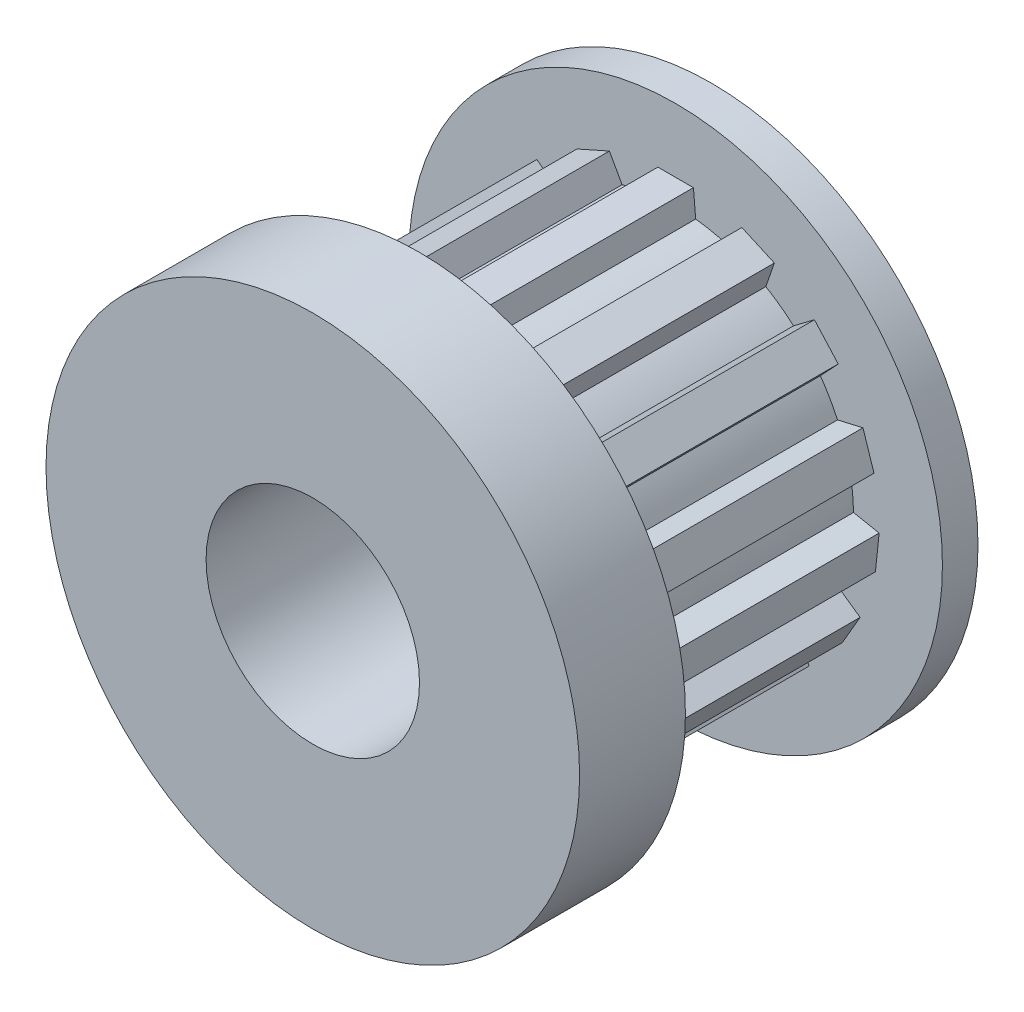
ISO-10303-21;
HEADER;
FILE_DESCRIPTION(('STEP AP214'),'2;1');
FILE_NAME('part.step','',(''),(''),'','','');
FILE_SCHEMA(('AUTOMOTIVE_DESIGN { 1 0 10303 214 1 1 1 1 }'));
ENDSEC;
DATA;
#1=APPLICATION_CONTEXT('core data for automotive mechanical design processes');
#2=APPLICATION_PROTOCOL_DEFINITION('international standard','automotive_design',2000,#1);
#3=PRODUCT_CONTEXT('',#1,'mechanical');
#4=PRODUCT('Part','Part','',(#3));
#5=PRODUCT_RELATED_PRODUCT_CATEGORY('part','',(#4));
#6=PRODUCT_DEFINITION_FORMATION('','',#4);
#7=PRODUCT_DEFINITION_CONTEXT('part definition',#1,'design');
#8=PRODUCT_DEFINITION('design','',#6,#7);
#9=PRODUCT_DEFINITION_SHAPE('','',#8);
#10=(LENGTH_UNIT() NAMED_UNIT(*) SI_UNIT(.MILLI.,.METRE.));
#11=(NAMED_UNIT(*) PLANE_ANGLE_UNIT() SI_UNIT($,.RADIAN.));
#12=(NAMED_UNIT(*) SI_UNIT($,.STERADIAN.) SOLID_ANGLE_UNIT());
#13=UNCERTAINTY_MEASURE_WITH_UNIT(LENGTH_MEASURE(1.E-05),#10,'distance_accuracy_value','');
#14=(GEOMETRIC_REPRESENTATION_CONTEXT(3) GLOBAL_UNCERTAINTY_ASSIGNED_CONTEXT((#13)) GLOBAL_UNIT_ASSIGNED_CONTEXT((#10,
#11,#12)) REPRESENTATION_CONTEXT('',''));
#15=CARTESIAN_POINT('',(0.,0.,0.));
#16=DIRECTION('',(0.,0.,1.));
#17=DIRECTION('',(1.,0.,0.));
#18=AXIS2_PLACEMENT_3D('',#15,#16,#17);
#19=CARTESIAN_POINT('',(0.,0.,0.));
#20=DIRECTION('',(0.,0.,1.));
#21=DIRECTION('',(1.,0.,0.));
#22=AXIS2_PLACEMENT_3D('',#19,#20,#21);
#23=CYLINDRICAL_SURFACE('',#22,7.5);
#24=CARTESIAN_POINT('',(0.,0.,-7.17513466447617));
#25=DIRECTION('',(0.,0.,-1.));
#26=DIRECTION('',(-1.,0.,0.));
#27=AXIS2_PLACEMENT_3D('',#24,#25,#26);
#28=CIRCLE('',#27,7.5);
#29=CARTESIAN_POINT('',(-7.5,0.,-7.17513466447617));
#30=VERTEX_POINT('',#29);
#31=EDGE_CURVE('E42',#30,#30,#28,.F.);
#32=ORIENTED_EDGE('',*,*,#31,.T.);
#33=EDGE_LOOP('',(#32));
#34=FACE_BOUND('',#33,.T.);
#35=CARTESIAN_POINT('',(0.,0.,-4.2));
#36=DIRECTION('',(0.,0.,1.));
#37=DIRECTION('',(1.,0.,0.));
#38=AXIS2_PLACEMENT_3D('',#35,#36,#37);
#39=CIRCLE('',#38,7.5);
#40=CARTESIAN_POINT('',(7.5,0.,-4.2));
#41=VERTEX_POINT('',#40);
#42=EDGE_CURVE('E418',#41,#41,#39,.F.);
#43=ORIENTED_EDGE('',*,*,#42,.T.);
#44=EDGE_LOOP('',(#43));
#45=FACE_BOUND('',#44,.T.);
#46=ADVANCED_FACE('F34',(#34,#45),#23,.T.);
#47=CARTESIAN_POINT('',(5.,0.,-7.4));
#48=DIRECTION('',(0.,0.,-1.));
#49=DIRECTION('',(-1.,0.,0.));
#50=AXIS2_PLACEMENT_3D('',#47,#48,#49);
#51=PLANE('',#50);
#52=CARTESIAN_POINT('',(0.,0.,-7.4));
#53=DIRECTION('',(0.,0.,-1.));
#54=DIRECTION('',(-1.,0.,0.));
#55=AXIS2_PLACEMENT_3D('',#52,#53,#54);
#56=CIRCLE('',#55,5.89999999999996);
#57=CARTESIAN_POINT('',(-5.89999999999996,0.,-7.4));
#58=VERTEX_POINT('',#57);
#59=EDGE_CURVE('E12',#58,#58,#56,.T.);
#60=ORIENTED_EDGE('',*,*,#59,.T.);
#61=EDGE_LOOP('',(#60));
#62=FACE_BOUND('',#61,.T.);
#63=DIRECTION('',(0.913545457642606,-0.406736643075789,0.));
#64=VECTOR('',#63,1.);
#65=CARTESIAN_POINT('',(2.7751715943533,5.00384078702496,-7.4));
#66=LINE('',#65,#64);
#67=CARTESIAN_POINT('',(1.86162613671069,5.41057743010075,-7.4));
#68=VERTEX_POINT('',#67);
#69=CARTESIAN_POINT('',(2.7751715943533,5.00384078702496,-7.4));
#70=VERTEX_POINT('',#69);
#71=EDGE_CURVE('E700',#68,#70,#66,.T.);
#72=ORIENTED_EDGE('',*,*,#71,.F.);
#73=DIRECTION('',(0.484809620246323,0.874619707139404,0.));
#74=VECTOR('',#73,1.);
#75=CARTESIAN_POINT('',(1.86162613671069,5.41057743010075,-7.4));
#76=LINE('',#75,#74);
#77=CARTESIAN_POINT('',(1.50543111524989,4.76798460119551,-7.4));
#78=VERTEX_POINT('',#77);
#79=EDGE_CURVE('E417',#78,#68,#76,.T.);
#80=ORIENTED_EDGE('',*,*,#79,.F.);
#81=CARTESIAN_POINT('',(0.,0.,-7.4));
#82=DIRECTION('',(0.,0.,1.));
#83=DIRECTION('',(1.,0.,0.));
#84=AXIS2_PLACEMENT_3D('',#81,#82,#83);
#85=CIRCLE('',#84,5.);
#86=CARTESIAN_POINT('',(0.564034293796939,4.96808467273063,-7.4));
#87=VERTEX_POINT('',#86);
#88=EDGE_CURVE('E437',#78,#87,#85,.T.);
#89=ORIENTED_EDGE('',*,*,#88,.T.);
#90=DIRECTION('',(0.0871557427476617,-0.996194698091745,0.));
#91=VECTOR('',#90,1.);
#92=CARTESIAN_POINT('',(0.5,5.7,-7.4));
#93=LINE('',#92,#91);
#94=CARTESIAN_POINT('',(0.5,5.7,-7.4));
#95=VERTEX_POINT('',#94);
#96=EDGE_CURVE('E997',#95,#87,#93,.T.);
#97=ORIENTED_EDGE('',*,*,#96,.F.);
#98=DIRECTION('',(1.,0.,0.));
#99=VECTOR('',#98,1.);
#100=CARTESIAN_POINT('',(0.5,5.7,-7.4));
#101=LINE('',#100,#99);
#102=CARTESIAN_POINT('',(-0.5,5.7,-7.4));
#103=VERTEX_POINT('',#102);
#104=EDGE_CURVE('E1027',#103,#95,#101,.T.);
#105=ORIENTED_EDGE('',*,*,#104,.F.);
#106=DIRECTION('',(0.0871557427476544,0.996194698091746,0.));
#107=VECTOR('',#106,1.);
#108=CARTESIAN_POINT('',(-0.5,5.7,-7.4));
#109=LINE('',#108,#107);
#110=CARTESIAN_POINT('',(-0.564034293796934,4.96808467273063,-7.4));
#111=VERTEX_POINT('',#110);
#112=EDGE_CURVE('E1024',#111,#103,#109,.T.);
#113=ORIENTED_EDGE('',*,*,#112,.F.);
#114=CARTESIAN_POINT('',(-1.50543111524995,4.76798460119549,-7.4));
#115=VERTEX_POINT('',#114);
#116=EDGE_CURVE('E442',#111,#115,#85,.T.);
#117=ORIENTED_EDGE('',*,*,#116,.T.);
#118=DIRECTION('',(0.484809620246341,-0.874619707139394,0.));
#119=VECTOR('',#118,1.);
#120=CARTESIAN_POINT('',(-1.86162613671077,5.41057743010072,-7.4));
#121=LINE('',#120,#119);
#122=CARTESIAN_POINT('',(-1.86162613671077,5.41057743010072,-7.4));
#123=VERTEX_POINT('',#122);
#124=EDGE_CURVE('E973',#123,#115,#121,.T.);
#125=ORIENTED_EDGE('',*,*,#124,.F.);
#126=DIRECTION('',(0.913545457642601,0.406736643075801,0.));
#127=VECTOR('',#126,1.);
#128=CARTESIAN_POINT('',(-1.86162613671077,5.41057743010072,-7.4));
#129=LINE('',#128,#127);
#130=CARTESIAN_POINT('',(-2.77517159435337,5.00384078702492,-7.4));
#131=VERTEX_POINT('',#130);
#132=EDGE_CURVE('E1002',#131,#123,#129,.T.);
#133=ORIENTED_EDGE('',*,*,#132,.F.);
#134=DIRECTION('',(-0.325568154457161,0.945518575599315,0.));
#135=VECTOR('',#134,1.);
#136=CARTESIAN_POINT('',(-2.77517159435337,5.00384078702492,-7.4));
#137=LINE('',#136,#135);
#138=CARTESIAN_POINT('',(-2.53597304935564,4.3091577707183,-7.4));
#139=VERTEX_POINT('',#138);
#140=EDGE_CURVE('E999',#139,#131,#137,.T.);
#141=ORIENTED_EDGE('',*,*,#140,.F.);
#142=CARTESIAN_POINT('',(-3.31459380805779,3.74345667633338,-7.4));
#143=VERTEX_POINT('',#142);
#144=EDGE_CURVE('E446',#139,#143,#85,.T.);
#145=ORIENTED_EDGE('',*,*,#144,.T.);
#146=DIRECTION('',(0.798635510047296,-0.601815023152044,0.));
#147=VECTOR('',#146,1.);
#148=CARTESIAN_POINT('',(-3.90136020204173,4.18561686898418,-7.4));
#149=LINE('',#148,#147);
#150=CARTESIAN_POINT('',(-3.90136020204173,4.18561686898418,-7.4));
#151=VERTEX_POINT('',#150);
#152=EDGE_CURVE('E949',#151,#143,#149,.T.);
#153=ORIENTED_EDGE('',*,*,#152,.F.);
#154=DIRECTION('',(0.669130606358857,0.743144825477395,0.));
#155=VECTOR('',#154,1.);
#156=CARTESIAN_POINT('',(-3.90136020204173,4.18561686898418,-7.4));
#157=LINE('',#156,#155);
#158=CARTESIAN_POINT('',(-4.57049080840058,3.44247204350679,-7.4));
#159=VERTEX_POINT('',#158);
#160=EDGE_CURVE('E978',#159,#151,#157,.T.);
#161=ORIENTED_EDGE('',*,*,#160,.F.);
#162=DIRECTION('',(-0.681998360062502,0.731353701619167,0.));
#163=VECTOR('',#162,1.);
#164=CARTESIAN_POINT('',(-4.57049080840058,3.44247204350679,-7.4));
#165=LINE('',#164,#163);
#166=CARTESIAN_POINT('',(-4.06941902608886,2.9051383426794,-7.4));
#167=VERTEX_POINT('',#166);
#168=EDGE_CURVE('E975',#167,#159,#165,.T.);
#169=ORIENTED_EDGE('',*,*,#168,.F.);
#170=CARTESIAN_POINT('',(-4.55063311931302,2.07165108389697,-7.4));
#171=VERTEX_POINT('',#170);
#172=EDGE_CURVE('E1170',#167,#171,#85,.T.);
#173=ORIENTED_EDGE('',*,*,#172,.T.);
#174=DIRECTION('',(0.974370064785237,-0.224951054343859,0.));
#175=VECTOR('',#174,1.);
#176=CARTESIAN_POINT('',(-5.26651364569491,2.23692512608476,-7.4));
#177=LINE('',#176,#175);
#178=CARTESIAN_POINT('',(-5.26651364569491,2.23692512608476,-7.4));
#179=VERTEX_POINT('',#178);
#180=EDGE_CURVE('E925',#179,#171,#177,.T.);
#181=ORIENTED_EDGE('',*,*,#180,.F.);
#182=DIRECTION('',(0.309016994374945,0.951056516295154,0.));
#183=VECTOR('',#182,1.);
#184=CARTESIAN_POINT('',(-5.26651364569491,2.23692512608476,-7.4));
#185=LINE('',#184,#183);
#186=CARTESIAN_POINT('',(-5.57553064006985,1.28586860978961,-7.4));
#187=VERTEX_POINT('',#186);
#188=EDGE_CURVE('E954',#187,#179,#185,.T.);
#189=ORIENTED_EDGE('',*,*,#188,.F.);
#190=DIRECTION('',(-0.920504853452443,0.390731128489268,0.));
#191=VECTOR('',#190,1.);
#192=CARTESIAN_POINT('',(-5.57553064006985,1.28586860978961,-7.4));
#193=LINE('',#192,#191);
#194=CARTESIAN_POINT('',(-4.89922548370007,0.998794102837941,-7.4));
#195=VERTEX_POINT('',#194);
#196=EDGE_CURVE('E951',#195,#187,#193,.T.);
#197=ORIENTED_EDGE('',*,*,#196,.F.);
#198=CARTESIAN_POINT('',(-4.99982662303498,0.0416381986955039,-7.4));
#199=VERTEX_POINT('',#198);
#200=EDGE_CURVE('E1165',#195,#199,#85,.T.);
#201=ORIENTED_EDGE('',*,*,#200,.T.);
#202=DIRECTION('',(0.981627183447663,0.190808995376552,0.));
#203=VECTOR('',#202,1.);
#204=CARTESIAN_POINT('',(-5.72103903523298,-0.0985512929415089,-7.4));
#205=LINE('',#204,#203);
#206=CARTESIAN_POINT('',(-5.72103903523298,-0.0985512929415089,-7.4));
#207=VERTEX_POINT('',#206);
#208=EDGE_CURVE('E901',#207,#199,#205,.T.);
#209=ORIENTED_EDGE('',*,*,#208,.F.);
#210=DIRECTION('',(-0.104528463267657,0.994521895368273,0.));
#211=VECTOR('',#210,1.);
#212=CARTESIAN_POINT('',(-5.72103903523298,-0.0985512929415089,-7.4));
#213=LINE('',#212,#211);
#214=CARTESIAN_POINT('',(-5.61651057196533,-1.09307318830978,-7.4));
#215=VERTEX_POINT('',#214);
#216=EDGE_CURVE('E930',#215,#207,#213,.T.);
#217=ORIENTED_EDGE('',*,*,#216,.F.);
#218=DIRECTION('',(-0.999847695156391,-0.0174524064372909,0.));
#219=VECTOR('',#218,1.);
#220=CARTESIAN_POINT('',(-5.61651057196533,-1.09307318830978,-7.4));
#221=LINE('',#220,#219);
#222=CARTESIAN_POINT('',(-4.88191134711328,-1.08025071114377,-7.4));
#223=VERTEX_POINT('',#222);
#224=EDGE_CURVE('E927',#223,#215,#221,.T.);
#225=ORIENTED_EDGE('',*,*,#224,.F.);
#226=CARTESIAN_POINT('',(-4.58450468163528,-1.99557430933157,-7.4));
#227=VERTEX_POINT('',#226);
#228=EDGE_CURVE('E1160',#223,#227,#85,.T.);
#229=ORIENTED_EDGE('',*,*,#228,.T.);
#230=DIRECTION('',(0.819152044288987,0.573576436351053,0.));
#231=VECTOR('',#230,1.);
#232=CARTESIAN_POINT('',(-5.18634480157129,-2.41698729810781,-7.4));
#233=LINE('',#232,#231);
#234=CARTESIAN_POINT('',(-5.18634480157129,-2.41698729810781,-7.4));
#235=VERTEX_POINT('',#234);
#236=EDGE_CURVE('E877',#235,#227,#233,.T.);
#237=ORIENTED_EDGE('',*,*,#236,.F.);
#238=DIRECTION('',(-0.500000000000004,0.866025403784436,0.));
#239=VECTOR('',#238,1.);
#240=CARTESIAN_POINT('',(-5.18634480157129,-2.41698729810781,-7.4));
#241=LINE('',#240,#239);
#242=CARTESIAN_POINT('',(-4.68634480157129,-3.28301270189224,-7.4));
#243=VERTEX_POINT('',#242);
#244=EDGE_CURVE('E906',#243,#235,#241,.T.);
#245=ORIENTED_EDGE('',*,*,#244,.F.);
#246=DIRECTION('',(-0.906307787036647,-0.422618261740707,0.));
#247=VECTOR('',#246,1.);
#248=CARTESIAN_POINT('',(-4.68634480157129,-3.28301270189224,-7.4));
#249=LINE('',#248,#247);
#250=CARTESIAN_POINT('',(-4.02047038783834,-2.97251036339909,-7.4));
#251=VERTEX_POINT('',#250);
#252=EDGE_CURVE('E903',#251,#243,#249,.T.);
#253=ORIENTED_EDGE('',*,*,#252,.F.);
#254=CARTESIAN_POINT('',(-3.37648023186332,-3.68773389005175,-7.4));
#255=VERTEX_POINT('',#254);
#256=EDGE_CURVE('E1155',#251,#255,#85,.T.);
#257=ORIENTED_EDGE('',*,*,#256,.T.);
#258=DIRECTION('',(0.515038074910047,0.857167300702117,0.));
#259=VECTOR('',#258,1.);
#260=CARTESIAN_POINT('',(-3.75488443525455,-4.31750424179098,-7.4));
#261=LINE('',#260,#259);
#262=CARTESIAN_POINT('',(-3.75488443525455,-4.31750424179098,-7.4));
#263=VERTEX_POINT('',#262);
#264=EDGE_CURVE('E853',#263,#255,#261,.T.);
#265=ORIENTED_EDGE('',*,*,#264,.F.);
#266=DIRECTION('',(-0.80901699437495,0.587785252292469,0.));
#267=VECTOR('',#266,1.);
#268=CARTESIAN_POINT('',(-3.75488443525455,-4.31750424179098,-7.4));
#269=LINE('',#268,#267);
#270=CARTESIAN_POINT('',(-2.9458674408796,-4.90528949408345,-7.4));
#271=VERTEX_POINT('',#270);
#272=EDGE_CURVE('E882',#271,#263,#269,.T.);
#273=ORIENTED_EDGE('',*,*,#272,.F.);
#274=DIRECTION('',(-0.6560590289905,-0.754709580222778,0.));
#275=VECTOR('',#274,1.);
#276=CARTESIAN_POINT('',(-2.9458674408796,-4.90528949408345,-7.4));
#277=LINE('',#276,#275);
#278=CARTESIAN_POINT('',(-2.46385357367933,-4.35079596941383,-7.4));
#279=VERTEX_POINT('',#278);
#280=EDGE_CURVE('E879',#279,#271,#277,.T.);
#281=ORIENTED_EDGE('',*,*,#280,.F.);
#282=CARTESIAN_POINT('',(-1.58463167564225,-4.74225077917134,-7.4));
#283=VERTEX_POINT('',#282);
#284=EDGE_CURVE('E1150',#279,#283,#85,.T.);
#285=ORIENTED_EDGE('',*,*,#284,.T.);
#286=DIRECTION('',(0.121869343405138,0.992546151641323,0.));
#287=VECTOR('',#286,1.);
#288=CARTESIAN_POINT('',(-1.6741704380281,-5.47148547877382,-7.4));
#289=LINE('',#288,#287);
#290=CARTESIAN_POINT('',(-1.6741704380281,-5.47148547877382,-7.4));
#291=VERTEX_POINT('',#290);
#292=EDGE_CURVE('E829',#291,#283,#289,.T.);
#293=ORIENTED_EDGE('',*,*,#292,.F.);
#294=DIRECTION('',(-0.978147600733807,0.207911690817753,0.));
#295=VECTOR('',#294,1.);
#296=CARTESIAN_POINT('',(-1.6741704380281,-5.47148547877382,-7.4));
#297=LINE('',#296,#295);
#298=CARTESIAN_POINT('',(-0.69602283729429,-5.67939716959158,-7.4));
#299=VERTEX_POINT('',#298);
#300=EDGE_CURVE('E858',#299,#291,#297,.T.);
#301=ORIENTED_EDGE('',*,*,#300,.F.);
#302=DIRECTION('',(-0.292371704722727,-0.956304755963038,0.));
#303=VECTOR('',#302,1.);
#304=CARTESIAN_POINT('',(-0.69602283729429,-5.67939716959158,-7.4));
#305=LINE('',#304,#303);
#306=CARTESIAN_POINT('',(-0.481214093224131,-4.97678942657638,-7.4));
#307=VERTEX_POINT('',#306);
#308=EDGE_CURVE('E855',#307,#299,#305,.T.);
#309=ORIENTED_EDGE('',*,*,#308,.F.);
#310=CARTESIAN_POINT('',(0.481214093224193,-4.97678942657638,-7.4));
#311=VERTEX_POINT('',#310);
#312=EDGE_CURVE('E1145',#307,#311,#85,.T.);
#313=ORIENTED_EDGE('',*,*,#312,.T.);
#314=DIRECTION('',(-0.292371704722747,0.956304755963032,0.));
#315=VECTOR('',#314,1.);
#316=CARTESIAN_POINT('',(0.696022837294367,-5.67939716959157,-7.4));
#317=LINE('',#316,#315);
#318=CARTESIAN_POINT('',(0.696022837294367,-5.67939716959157,-7.4));
#319=VERTEX_POINT('',#318);
#320=EDGE_CURVE('E805',#319,#311,#317,.T.);
#321=ORIENTED_EDGE('',*,*,#320,.F.);
#322=DIRECTION('',(-0.978147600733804,-0.207911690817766,0.));
#323=VECTOR('',#322,1.);
#324=CARTESIAN_POINT('',(0.696022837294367,-5.67939716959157,-7.4));
#325=LINE('',#324,#323);
#326=CARTESIAN_POINT('',(1.67417043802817,-5.4714854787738,-7.4));
#327=VERTEX_POINT('',#326);
#328=EDGE_CURVE('E834',#327,#319,#325,.T.);
#329=ORIENTED_EDGE('',*,*,#328,.F.);
#330=DIRECTION('',(0.121869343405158,-0.992546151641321,0.));
#331=VECTOR('',#330,1.);
#332=CARTESIAN_POINT('',(1.67417043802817,-5.4714854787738,-7.4));
#333=LINE('',#332,#331);
#334=CARTESIAN_POINT('',(1.58463167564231,-4.74225077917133,-7.4));
#335=VERTEX_POINT('',#334);
#336=EDGE_CURVE('E831',#335,#327,#333,.T.);
#337=ORIENTED_EDGE('',*,*,#336,.F.);
#338=CARTESIAN_POINT('',(2.46385357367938,-4.3507959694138,-7.4));
#339=VERTEX_POINT('',#338);
#340=EDGE_CURVE('E1140',#335,#339,#85,.T.);
#341=ORIENTED_EDGE('',*,*,#340,.T.);
#342=DIRECTION('',(-0.656059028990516,0.754709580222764,0.));
#343=VECTOR('',#342,1.);
#344=CARTESIAN_POINT('',(2.94586744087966,-4.90528949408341,-7.4));
#345=LINE('',#344,#343);
#346=CARTESIAN_POINT('',(2.94586744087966,-4.90528949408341,-7.4));
#347=VERTEX_POINT('',#346);
#348=EDGE_CURVE('E781',#347,#339,#345,.T.);
#349=ORIENTED_EDGE('',*,*,#348,.F.);
#350=DIRECTION('',(-0.809016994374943,-0.58778525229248,0.));
#351=VECTOR('',#350,1.);
#352=CARTESIAN_POINT('',(2.94586744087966,-4.90528949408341,-7.4));
#353=LINE('',#352,#351);
#354=CARTESIAN_POINT('',(3.75488443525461,-4.31750424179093,-7.4));
#355=VERTEX_POINT('',#354);
#356=EDGE_CURVE('E810',#355,#347,#353,.T.);
#357=ORIENTED_EDGE('',*,*,#356,.F.);
#358=DIRECTION('',(0.515038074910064,-0.857167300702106,0.));
#359=VECTOR('',#358,1.);
#360=CARTESIAN_POINT('',(3.75488443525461,-4.31750424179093,-7.4));
#361=LINE('',#360,#359);
#362=CARTESIAN_POINT('',(3.37648023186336,-3.68773389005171,-7.4));
#363=VERTEX_POINT('',#362);
#364=EDGE_CURVE('E807',#363,#355,#361,.T.);
#365=ORIENTED_EDGE('',*,*,#364,.F.);
#366=CARTESIAN_POINT('',(4.02047038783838,-2.97251036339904,-7.4));
#367=VERTEX_POINT('',#366);
#368=EDGE_CURVE('E1135',#363,#367,#85,.T.);
#369=ORIENTED_EDGE('',*,*,#368,.T.);
#370=DIRECTION('',(-0.906307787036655,0.422618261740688,0.));
#371=VECTOR('',#370,1.);
#372=CARTESIAN_POINT('',(4.68634480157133,-3.28301270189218,-7.4));
#373=LINE('',#372,#371);
#374=CARTESIAN_POINT('',(4.68634480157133,-3.28301270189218,-7.4));
#375=VERTEX_POINT('',#374);
#376=EDGE_CURVE('E757',#375,#367,#373,.T.);
#377=ORIENTED_EDGE('',*,*,#376,.F.);
#378=DIRECTION('',(-0.499999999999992,-0.866025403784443,0.));
#379=VECTOR('',#378,1.);
#380=CARTESIAN_POINT('',(4.68634480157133,-3.28301270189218,-7.4));
#381=LINE('',#380,#379);
#382=CARTESIAN_POINT('',(5.18634480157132,-2.41698729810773,-7.4));
#383=VERTEX_POINT('',#382);
#384=EDGE_CURVE('E786',#383,#375,#381,.T.);
#385=ORIENTED_EDGE('',*,*,#384,.F.);
#386=DIRECTION('',(0.819152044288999,-0.573576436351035,0.));
#387=VECTOR('',#386,1.);
#388=CARTESIAN_POINT('',(5.18634480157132,-2.41698729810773,-7.4));
#389=LINE('',#388,#387);
#390=CARTESIAN_POINT('',(4.58450468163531,-1.99557430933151,-7.4));
#391=VERTEX_POINT('',#390);
#392=EDGE_CURVE('E783',#391,#383,#389,.T.);
#393=ORIENTED_EDGE('',*,*,#392,.F.);
#394=CARTESIAN_POINT('',(4.88191134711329,-1.0802507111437,-7.4));
#395=VERTEX_POINT('',#394);
#396=EDGE_CURVE('E1133',#391,#395,#85,.T.);
#397=ORIENTED_EDGE('',*,*,#396,.T.);
#398=DIRECTION('',(-0.999847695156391,0.0174524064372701,0.));
#399=VECTOR('',#398,1.);
#400=CARTESIAN_POINT('',(5.61651057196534,-1.09307318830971,-7.4));
#401=LINE('',#400,#399);
#402=CARTESIAN_POINT('',(5.61651057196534,-1.09307318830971,-7.4));
#403=VERTEX_POINT('',#402);
#404=EDGE_CURVE('E733',#403,#395,#401,.T.);
#405=ORIENTED_EDGE('',*,*,#404,.F.);
#406=DIRECTION('',(-0.104528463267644,-0.994521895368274,0.));
#407=VECTOR('',#406,1.);
#408=CARTESIAN_POINT('',(5.61651057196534,-1.09307318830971,-7.4));
#409=LINE('',#408,#407);
#410=CARTESIAN_POINT('',(5.72103903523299,-0.0985512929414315,-7.4));
#411=VERTEX_POINT('',#410);
#412=EDGE_CURVE('E762',#411,#403,#409,.T.);
#413=ORIENTED_EDGE('',*,*,#412,.F.);
#414=DIRECTION('',(0.981627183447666,-0.190808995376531,0.));
#415=VECTOR('',#414,1.);
#416=CARTESIAN_POINT('',(5.72103903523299,-0.0985512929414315,-7.4));
#417=LINE('',#416,#415);
#418=CARTESIAN_POINT('',(4.99982662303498,0.041638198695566,-7.4));
#419=VERTEX_POINT('',#418);
#420=EDGE_CURVE('E759',#419,#411,#417,.T.);
#421=ORIENTED_EDGE('',*,*,#420,.F.);
#422=CARTESIAN_POINT('',(4.89922548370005,0.998794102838,-7.4));
#423=VERTEX_POINT('',#422);
#424=EDGE_CURVE('E440',#419,#423,#85,.T.);
#425=ORIENTED_EDGE('',*,*,#424,.T.);
#426=DIRECTION('',(-0.920504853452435,-0.390731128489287,0.));
#427=VECTOR('',#426,1.);
#428=CARTESIAN_POINT('',(5.57553064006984,1.28586860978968,-7.4));
#429=LINE('',#428,#427);
#430=CARTESIAN_POINT('',(5.57553064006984,1.28586860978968,-7.4));
#431=VERTEX_POINT('',#430);
#432=EDGE_CURVE('E713',#431,#423,#429,.T.);
#433=ORIENTED_EDGE('',*,*,#432,.F.);
#434=DIRECTION('',(0.309016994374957,-0.95105651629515,0.));
#435=VECTOR('',#434,1.);
#436=CARTESIAN_POINT('',(5.57553064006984,1.28586860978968,-7.4));
#437=LINE('',#436,#435);
#438=CARTESIAN_POINT('',(5.26651364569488,2.23692512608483,-7.4));
#439=VERTEX_POINT('',#438);
#440=EDGE_CURVE('E738',#439,#431,#437,.T.);
#441=ORIENTED_EDGE('',*,*,#440,.F.);
#442=DIRECTION('',(0.974370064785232,0.224951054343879,0.));
#443=VECTOR('',#442,1.);
#444=CARTESIAN_POINT('',(5.26651364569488,2.23692512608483,-7.4));
#445=LINE('',#444,#443);
#446=CARTESIAN_POINT('',(4.55063311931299,2.07165108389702,-7.4));
#447=VERTEX_POINT('',#446);
#448=EDGE_CURVE('E735',#447,#439,#445,.T.);
#449=ORIENTED_EDGE('',*,*,#448,.F.);
#450=CARTESIAN_POINT('',(4.06941902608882,2.90513834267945,-7.4));
#451=VERTEX_POINT('',#450);
#452=EDGE_CURVE('E436',#447,#451,#85,.T.);
#453=ORIENTED_EDGE('',*,*,#452,.T.);
#454=DIRECTION('',(-0.681998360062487,-0.731353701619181,0.));
#455=VECTOR('',#454,1.);
#456=CARTESIAN_POINT('',(4.57049080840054,3.44247204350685,-7.4));
#457=LINE('',#456,#455);
#458=CARTESIAN_POINT('',(4.57049080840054,3.44247204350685,-7.4));
#459=VERTEX_POINT('',#458);
#460=EDGE_CURVE('E696',#459,#451,#457,.T.);
#461=ORIENTED_EDGE('',*,*,#460,.F.);
#462=DIRECTION('',(0.669130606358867,-0.743144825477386,0.));
#463=VECTOR('',#462,1.);
#464=CARTESIAN_POINT('',(4.57049080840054,3.44247204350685,-7.4));
#465=LINE('',#464,#463);
#466=CARTESIAN_POINT('',(3.90136020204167,4.18561686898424,-7.4));
#467=VERTEX_POINT('',#466);
#468=EDGE_CURVE('E716',#467,#459,#465,.T.);
#469=ORIENTED_EDGE('',*,*,#468,.F.);
#470=DIRECTION('',(0.798635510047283,0.601815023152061,0.));
#471=VECTOR('',#470,1.);
#472=CARTESIAN_POINT('',(3.90136020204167,4.18561686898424,-7.4));
#473=LINE('',#472,#471);
#474=CARTESIAN_POINT('',(3.31459380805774,3.74345667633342,-7.4));
#475=VERTEX_POINT('',#474);
#476=EDGE_CURVE('E435',#475,#467,#473,.T.);
#477=ORIENTED_EDGE('',*,*,#476,.F.);
#478=CARTESIAN_POINT('',(2.53597304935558,4.30915777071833,-7.4));
#479=VERTEX_POINT('',#478);
#480=EDGE_CURVE('E425',#475,#479,#85,.T.);
#481=ORIENTED_EDGE('',*,*,#480,.T.);
#482=DIRECTION('',(-0.325568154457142,-0.945518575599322,0.));
#483=VECTOR('',#482,1.);
#484=CARTESIAN_POINT('',(2.7751715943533,5.00384078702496,-7.4));
#485=LINE('',#484,#483);
#486=EDGE_CURVE('E409',#70,#479,#485,.T.);
#487=ORIENTED_EDGE('',*,*,#486,.F.);
#488=EDGE_LOOP('',(#72,#80,#89,#97,#105,#113,#117,#125,#133,#141,#145,#153,#161,#169,#173,#181,
#189,#197,#201,#209,#217,#225,#229,#237,#245,#253,#257,#265,#273,#281,#285,#293,#301,#309,#313,
#321,#329,#337,#341,#349,#357,#365,#369,#377,#385,#393,#397,#405,#413,#421,#425,#433,#441,#449,
#453,#461,#469,#477,#481,#487));
#489=FACE_BOUND('',#488,.T.);
#490=ADVANCED_FACE('F432',(#62,#489),#51,.T.);
#491=CARTESIAN_POINT('',(0.,0.,0.));
#492=DIRECTION('',(0.,0.,1.));
#493=DIRECTION('',(1.,0.,0.));
#494=AXIS2_PLACEMENT_3D('',#491,#492,#493);
#495=CYLINDRICAL_SURFACE('',#494,5.);
#496=ORIENTED_EDGE('',*,*,#88,.F.);
#497=DIRECTION('',(0.,0.,1.));
#498=VECTOR('',#497,1.);
#499=CARTESIAN_POINT('',(1.50543111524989,4.76798460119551,-16.0808825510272));
#500=LINE('',#499,#498);
#501=CARTESIAN_POINT('',(1.50543111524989,4.76798460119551,-14.4));
#502=VERTEX_POINT('',#501);
#503=EDGE_CURVE('E429',#502,#78,#500,.T.);
#504=ORIENTED_EDGE('',*,*,#503,.F.);
#505=CARTESIAN_POINT('',(0.,0.,-14.4));
#506=DIRECTION('',(0.,0.,1.));
#507=DIRECTION('',(1.,0.,0.));
#508=AXIS2_PLACEMENT_3D('',#505,#506,#507);
#509=CIRCLE('',#508,5.);
#510=CARTESIAN_POINT('',(0.564034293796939,4.96808467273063,-14.4));
#511=VERTEX_POINT('',#510);
#512=EDGE_CURVE('E1045',#502,#511,#509,.T.);
#513=ORIENTED_EDGE('',*,*,#512,.T.);
#514=DIRECTION('',(0.,0.,1.));
#515=VECTOR('',#514,1.);
#516=CARTESIAN_POINT('',(0.564034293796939,4.96808467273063,-15.7447076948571));
#517=LINE('',#516,#515);
#518=EDGE_CURVE('E1036',#511,#87,#517,.T.);
#519=ORIENTED_EDGE('',*,*,#518,.T.);
#520=EDGE_LOOP('',(#496,#504,#513,#519));
#521=FACE_BOUND('',#520,.T.);
#522=ADVANCED_FACE('F474',(#521),#495,.T.);
#523=CARTESIAN_POINT('',(3.31459380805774,3.74345667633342,-14.4));
#524=VERTEX_POINT('',#523);
#525=CARTESIAN_POINT('',(2.53597304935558,4.30915777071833,-14.4));
#526=VERTEX_POINT('',#525);
#527=EDGE_CURVE('E427',#524,#526,#509,.T.);
#528=ORIENTED_EDGE('',*,*,#527,.T.);
#529=DIRECTION('',(0.,0.,1.));
#530=VECTOR('',#529,1.);
#531=CARTESIAN_POINT('',(2.53597304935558,4.30915777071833,-16.0808825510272));
#532=LINE('',#531,#530);
#533=EDGE_CURVE('E49',#526,#479,#532,.T.);
#534=ORIENTED_EDGE('',*,*,#533,.T.);
#535=ORIENTED_EDGE('',*,*,#480,.F.);
#536=DIRECTION('',(0.,0.,1.));
#537=VECTOR('',#536,1.);
#538=CARTESIAN_POINT('',(3.31459380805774,3.74345667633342,-16.1935725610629));
#539=LINE('',#538,#537);
#540=EDGE_CURVE('E723',#524,#475,#539,.T.);
#541=ORIENTED_EDGE('',*,*,#540,.F.);
#542=EDGE_LOOP('',(#528,#534,#535,#541));
#543=FACE_BOUND('',#542,.T.);
#544=ADVANCED_FACE('F423',(#543),#495,.T.);
#545=CARTESIAN_POINT('',(5.,0.,-14.4));
#546=DIRECTION('',(0.,0.,1.));
#547=DIRECTION('',(1.,0.,0.));
#548=AXIS2_PLACEMENT_3D('',#545,#546,#547);
#549=PLANE('',#548);
#550=CARTESIAN_POINT('',(0.,0.,-14.4));
#551=DIRECTION('',(0.,0.,1.));
#552=DIRECTION('',(1.,0.,0.));
#553=AXIS2_PLACEMENT_3D('',#550,#551,#552);
#554=CIRCLE('',#553,7.5);
#555=CARTESIAN_POINT('',(7.5,0.,-14.4));
#556=VERTEX_POINT('',#555);
#557=EDGE_CURVE('E450',#556,#556,#554,.T.);
#558=ORIENTED_EDGE('',*,*,#557,.T.);
#559=EDGE_LOOP('',(#558));
#560=FACE_BOUND('',#559,.T.);
#561=ORIENTED_EDGE('',*,*,#512,.F.);
#562=DIRECTION('',(-0.484809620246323,-0.874619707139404,0.));
#563=VECTOR('',#562,1.);
#564=CARTESIAN_POINT('',(1.86162613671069,5.41057743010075,-14.4));
#565=LINE('',#564,#563);
#566=CARTESIAN_POINT('',(1.86162613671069,5.41057743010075,-14.4));
#567=VERTEX_POINT('',#566);
#568=EDGE_CURVE('E693',#567,#502,#565,.T.);
#569=ORIENTED_EDGE('',*,*,#568,.F.);
#570=DIRECTION('',(-0.913545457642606,0.406736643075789,0.));
#571=VECTOR('',#570,1.);
#572=CARTESIAN_POINT('',(2.7751715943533,5.00384078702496,-14.4));
#573=LINE('',#572,#571);
#574=CARTESIAN_POINT('',(2.7751715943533,5.00384078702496,-14.4));
#575=VERTEX_POINT('',#574);
#576=EDGE_CURVE('E428',#575,#567,#573,.T.);
#577=ORIENTED_EDGE('',*,*,#576,.F.);
#578=DIRECTION('',(0.325568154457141,0.945518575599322,0.));
#579=VECTOR('',#578,1.);
#580=CARTESIAN_POINT('',(2.7751715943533,5.00384078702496,-14.4));
#581=LINE('',#580,#579);
#582=EDGE_CURVE('E695',#526,#575,#581,.T.);
#583=ORIENTED_EDGE('',*,*,#582,.F.);
#584=ORIENTED_EDGE('',*,*,#527,.F.);
#585=DIRECTION('',(-0.798635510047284,-0.601815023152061,0.));
#586=VECTOR('',#585,1.);
#587=CARTESIAN_POINT('',(3.90136020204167,4.18561686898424,-14.4));
#588=LINE('',#587,#586);
#589=CARTESIAN_POINT('',(3.90136020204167,4.18561686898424,-14.4));
#590=VERTEX_POINT('',#589);
#591=EDGE_CURVE('E708',#590,#524,#588,.T.);
#592=ORIENTED_EDGE('',*,*,#591,.F.);
#593=DIRECTION('',(-0.669130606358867,0.743144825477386,0.));
#594=VECTOR('',#593,1.);
#595=CARTESIAN_POINT('',(4.57049080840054,3.44247204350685,-14.4));
#596=LINE('',#595,#594);
#597=CARTESIAN_POINT('',(4.57049080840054,3.44247204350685,-14.4));
#598=VERTEX_POINT('',#597);
#599=EDGE_CURVE('E711',#598,#590,#596,.T.);
#600=ORIENTED_EDGE('',*,*,#599,.F.);
#601=DIRECTION('',(0.681998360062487,0.731353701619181,0.));
#602=VECTOR('',#601,1.);
#603=CARTESIAN_POINT('',(4.57049080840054,3.44247204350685,-14.4));
#604=LINE('',#603,#602);
#605=CARTESIAN_POINT('',(4.06941902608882,2.90513834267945,-14.4));
#606=VERTEX_POINT('',#605);
#607=EDGE_CURVE('E710',#606,#598,#604,.T.);
#608=ORIENTED_EDGE('',*,*,#607,.F.);
#609=CARTESIAN_POINT('',(4.55063311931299,2.07165108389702,-14.4));
#610=VERTEX_POINT('',#609);
#611=EDGE_CURVE('E1050',#610,#606,#509,.T.);
#612=ORIENTED_EDGE('',*,*,#611,.F.);
#613=DIRECTION('',(-0.974370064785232,-0.224951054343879,0.));
#614=VECTOR('',#613,1.);
#615=CARTESIAN_POINT('',(5.26651364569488,2.23692512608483,-14.4));
#616=LINE('',#615,#614);
#617=CARTESIAN_POINT('',(5.26651364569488,2.23692512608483,-14.4));
#618=VERTEX_POINT('',#617);
#619=EDGE_CURVE('E728',#618,#610,#616,.T.);
#620=ORIENTED_EDGE('',*,*,#619,.F.);
#621=DIRECTION('',(-0.309016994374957,0.95105651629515,0.));
#622=VECTOR('',#621,1.);
#623=CARTESIAN_POINT('',(5.57553064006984,1.28586860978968,-14.4));
#624=LINE('',#623,#622);
#625=CARTESIAN_POINT('',(5.57553064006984,1.28586860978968,-14.4));
#626=VERTEX_POINT('',#625);
#627=EDGE_CURVE('E731',#626,#618,#624,.T.);
#628=ORIENTED_EDGE('',*,*,#627,.F.);
#629=DIRECTION('',(0.920504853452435,0.390731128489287,0.));
#630=VECTOR('',#629,1.);
#631=CARTESIAN_POINT('',(5.57553064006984,1.28586860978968,-14.4));
#632=LINE('',#631,#630);
#633=CARTESIAN_POINT('',(4.89922548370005,0.998794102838,-14.4));
#634=VERTEX_POINT('',#633);
#635=EDGE_CURVE('E730',#634,#626,#632,.T.);
#636=ORIENTED_EDGE('',*,*,#635,.F.);
#637=CARTESIAN_POINT('',(4.99982662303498,0.041638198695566,-14.4));
#638=VERTEX_POINT('',#637);
#639=EDGE_CURVE('E1102',#638,#634,#509,.T.);
#640=ORIENTED_EDGE('',*,*,#639,.F.);
#641=DIRECTION('',(-0.981627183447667,0.190808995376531,0.));
#642=VECTOR('',#641,1.);
#643=CARTESIAN_POINT('',(5.72103903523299,-0.0985512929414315,-14.4));
#644=LINE('',#643,#642);
#645=CARTESIAN_POINT('',(5.72103903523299,-0.0985512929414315,-14.4));
#646=VERTEX_POINT('',#645);
#647=EDGE_CURVE('E752',#646,#638,#644,.T.);
#648=ORIENTED_EDGE('',*,*,#647,.F.);
#649=DIRECTION('',(0.104528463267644,0.994521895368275,0.));
#650=VECTOR('',#649,1.);
#651=CARTESIAN_POINT('',(5.61651057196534,-1.09307318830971,-14.4));
#652=LINE('',#651,#650);
#653=CARTESIAN_POINT('',(5.61651057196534,-1.09307318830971,-14.4));
#654=VERTEX_POINT('',#653);
#655=EDGE_CURVE('E755',#654,#646,#652,.T.);
#656=ORIENTED_EDGE('',*,*,#655,.F.);
#657=DIRECTION('',(0.999847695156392,-0.0174524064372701,0.));
#658=VECTOR('',#657,1.);
#659=CARTESIAN_POINT('',(5.61651057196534,-1.09307318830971,-14.4));
#660=LINE('',#659,#658);
#661=CARTESIAN_POINT('',(4.88191134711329,-1.08025071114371,-14.4));
#662=VERTEX_POINT('',#661);
#663=EDGE_CURVE('E754',#662,#654,#660,.T.);
#664=ORIENTED_EDGE('',*,*,#663,.F.);
#665=CARTESIAN_POINT('',(4.58450468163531,-1.99557430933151,-14.4));
#666=VERTEX_POINT('',#665);
#667=EDGE_CURVE('E1097',#666,#662,#509,.T.);
#668=ORIENTED_EDGE('',*,*,#667,.F.);
#669=DIRECTION('',(-0.819152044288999,0.573576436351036,0.));
#670=VECTOR('',#669,1.);
#671=CARTESIAN_POINT('',(5.18634480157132,-2.41698729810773,-14.4));
#672=LINE('',#671,#670);
#673=CARTESIAN_POINT('',(5.18634480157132,-2.41698729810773,-14.4));
#674=VERTEX_POINT('',#673);
#675=EDGE_CURVE('E776',#674,#666,#672,.T.);
#676=ORIENTED_EDGE('',*,*,#675,.F.);
#677=DIRECTION('',(0.499999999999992,0.866025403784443,0.));
#678=VECTOR('',#677,1.);
#679=CARTESIAN_POINT('',(4.68634480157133,-3.28301270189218,-14.4));
#680=LINE('',#679,#678);
#681=CARTESIAN_POINT('',(4.68634480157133,-3.28301270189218,-14.4));
#682=VERTEX_POINT('',#681);
#683=EDGE_CURVE('E779',#682,#674,#680,.T.);
#684=ORIENTED_EDGE('',*,*,#683,.F.);
#685=DIRECTION('',(0.906307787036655,-0.422618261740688,0.));
#686=VECTOR('',#685,1.);
#687=CARTESIAN_POINT('',(4.68634480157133,-3.28301270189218,-14.4));
#688=LINE('',#687,#686);
#689=CARTESIAN_POINT('',(4.02047038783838,-2.97251036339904,-14.4));
#690=VERTEX_POINT('',#689);
#691=EDGE_CURVE('E778',#690,#682,#688,.T.);
#692=ORIENTED_EDGE('',*,*,#691,.F.);
#693=CARTESIAN_POINT('',(3.37648023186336,-3.68773389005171,-14.4));
#694=VERTEX_POINT('',#693);
#695=EDGE_CURVE('E1092',#694,#690,#509,.T.);
#696=ORIENTED_EDGE('',*,*,#695,.F.);
#697=DIRECTION('',(-0.515038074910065,0.857167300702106,0.));
#698=VECTOR('',#697,1.);
#699=CARTESIAN_POINT('',(3.75488443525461,-4.31750424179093,-14.4));
#700=LINE('',#699,#698);
#701=CARTESIAN_POINT('',(3.75488443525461,-4.31750424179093,-14.4));
#702=VERTEX_POINT('',#701);
#703=EDGE_CURVE('E800',#702,#694,#700,.T.);
#704=ORIENTED_EDGE('',*,*,#703,.F.);
#705=DIRECTION('',(0.809016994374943,0.58778525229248,0.));
#706=VECTOR('',#705,1.);
#707=CARTESIAN_POINT('',(2.94586744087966,-4.90528949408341,-14.4));
#708=LINE('',#707,#706);
#709=CARTESIAN_POINT('',(2.94586744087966,-4.90528949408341,-14.4));
#710=VERTEX_POINT('',#709);
#711=EDGE_CURVE('E803',#710,#702,#708,.T.);
#712=ORIENTED_EDGE('',*,*,#711,.F.);
#713=DIRECTION('',(0.656059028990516,-0.754709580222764,0.));
#714=VECTOR('',#713,1.);
#715=CARTESIAN_POINT('',(2.94586744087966,-4.90528949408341,-14.4));
#716=LINE('',#715,#714);
#717=CARTESIAN_POINT('',(2.46385357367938,-4.3507959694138,-14.4));
#718=VERTEX_POINT('',#717);
#719=EDGE_CURVE('E802',#718,#710,#716,.T.);
#720=ORIENTED_EDGE('',*,*,#719,.F.);
#721=CARTESIAN_POINT('',(1.58463167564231,-4.74225077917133,-14.4));
#722=VERTEX_POINT('',#721);
#723=EDGE_CURVE('E1087',#722,#718,#509,.T.);
#724=ORIENTED_EDGE('',*,*,#723,.F.);
#725=DIRECTION('',(-0.121869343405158,0.992546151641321,0.));
#726=VECTOR('',#725,1.);
#727=CARTESIAN_POINT('',(1.67417043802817,-5.4714854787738,-14.4));
#728=LINE('',#727,#726);
#729=CARTESIAN_POINT('',(1.67417043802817,-5.4714854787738,-14.4));
#730=VERTEX_POINT('',#729);
#731=EDGE_CURVE('E824',#730,#722,#728,.T.);
#732=ORIENTED_EDGE('',*,*,#731,.F.);
#733=DIRECTION('',(0.978147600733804,0.207911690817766,0.));
#734=VECTOR('',#733,1.);
#735=CARTESIAN_POINT('',(0.696022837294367,-5.67939716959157,-14.4));
#736=LINE('',#735,#734);
#737=CARTESIAN_POINT('',(0.696022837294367,-5.67939716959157,-14.4));
#738=VERTEX_POINT('',#737);
#739=EDGE_CURVE('E827',#738,#730,#736,.T.);
#740=ORIENTED_EDGE('',*,*,#739,.F.);
#741=DIRECTION('',(0.292371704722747,-0.956304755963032,0.));
#742=VECTOR('',#741,1.);
#743=CARTESIAN_POINT('',(0.696022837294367,-5.67939716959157,-14.4));
#744=LINE('',#743,#742);
#745=CARTESIAN_POINT('',(0.481214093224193,-4.97678942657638,-14.4));
#746=VERTEX_POINT('',#745);
#747=EDGE_CURVE('E826',#746,#738,#744,.T.);
#748=ORIENTED_EDGE('',*,*,#747,.F.);
#749=CARTESIAN_POINT('',(-0.481214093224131,-4.97678942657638,-14.4));
#750=VERTEX_POINT('',#749);
#751=EDGE_CURVE('E1082',#750,#746,#509,.T.);
#752=ORIENTED_EDGE('',*,*,#751,.F.);
#753=DIRECTION('',(0.292371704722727,0.956304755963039,0.));
#754=VECTOR('',#753,1.);
#755=CARTESIAN_POINT('',(-0.69602283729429,-5.67939716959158,-14.4));
#756=LINE('',#755,#754);
#757=CARTESIAN_POINT('',(-0.69602283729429,-5.67939716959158,-14.4));
#758=VERTEX_POINT('',#757);
#759=EDGE_CURVE('E848',#758,#750,#756,.T.);
#760=ORIENTED_EDGE('',*,*,#759,.F.);
#761=DIRECTION('',(0.978147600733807,-0.207911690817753,0.));
#762=VECTOR('',#761,1.);
#763=CARTESIAN_POINT('',(-1.6741704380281,-5.47148547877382,-14.4));
#764=LINE('',#763,#762);
#765=CARTESIAN_POINT('',(-1.6741704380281,-5.47148547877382,-14.4));
#766=VERTEX_POINT('',#765);
#767=EDGE_CURVE('E851',#766,#758,#764,.T.);
#768=ORIENTED_EDGE('',*,*,#767,.F.);
#769=DIRECTION('',(-0.121869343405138,-0.992546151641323,0.));
#770=VECTOR('',#769,1.);
#771=CARTESIAN_POINT('',(-1.6741704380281,-5.47148547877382,-14.4));
#772=LINE('',#771,#770);
#773=CARTESIAN_POINT('',(-1.58463167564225,-4.74225077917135,-14.4));
#774=VERTEX_POINT('',#773);
#775=EDGE_CURVE('E850',#774,#766,#772,.T.);
#776=ORIENTED_EDGE('',*,*,#775,.F.);
#777=CARTESIAN_POINT('',(-2.46385357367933,-4.35079596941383,-14.4));
#778=VERTEX_POINT('',#777);
#779=EDGE_CURVE('E1077',#778,#774,#509,.T.);
#780=ORIENTED_EDGE('',*,*,#779,.F.);
#781=DIRECTION('',(0.656059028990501,0.754709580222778,0.));
#782=VECTOR('',#781,1.);
#783=CARTESIAN_POINT('',(-2.9458674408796,-4.90528949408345,-14.4));
#784=LINE('',#783,#782);
#785=CARTESIAN_POINT('',(-2.9458674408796,-4.90528949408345,-14.4));
#786=VERTEX_POINT('',#785);
#787=EDGE_CURVE('E872',#786,#778,#784,.T.);
#788=ORIENTED_EDGE('',*,*,#787,.F.);
#789=DIRECTION('',(0.80901699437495,-0.587785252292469,0.));
#790=VECTOR('',#789,1.);
#791=CARTESIAN_POINT('',(-3.75488443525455,-4.31750424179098,-14.4));
#792=LINE('',#791,#790);
#793=CARTESIAN_POINT('',(-3.75488443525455,-4.31750424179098,-14.4));
#794=VERTEX_POINT('',#793);
#795=EDGE_CURVE('E875',#794,#786,#792,.T.);
#796=ORIENTED_EDGE('',*,*,#795,.F.);
#797=DIRECTION('',(-0.515038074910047,-0.857167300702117,0.));
#798=VECTOR('',#797,1.);
#799=CARTESIAN_POINT('',(-3.75488443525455,-4.31750424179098,-14.4));
#800=LINE('',#799,#798);
#801=CARTESIAN_POINT('',(-3.37648023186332,-3.68773389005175,-14.4));
#802=VERTEX_POINT('',#801);
#803=EDGE_CURVE('E874',#802,#794,#800,.T.);
#804=ORIENTED_EDGE('',*,*,#803,.F.);
#805=CARTESIAN_POINT('',(-4.02047038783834,-2.97251036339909,-14.4));
#806=VERTEX_POINT('',#805);
#807=EDGE_CURVE('E1072',#806,#802,#509,.T.);
#808=ORIENTED_EDGE('',*,*,#807,.F.);
#809=DIRECTION('',(0.906307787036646,0.422618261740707,0.));
#810=VECTOR('',#809,1.);
#811=CARTESIAN_POINT('',(-4.68634480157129,-3.28301270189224,-14.4));
#812=LINE('',#811,#810);
#813=CARTESIAN_POINT('',(-4.68634480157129,-3.28301270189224,-14.4));
#814=VERTEX_POINT('',#813);
#815=EDGE_CURVE('E896',#814,#806,#812,.T.);
#816=ORIENTED_EDGE('',*,*,#815,.F.);
#817=DIRECTION('',(0.500000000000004,-0.866025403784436,0.));
#818=VECTOR('',#817,1.);
#819=CARTESIAN_POINT('',(-5.18634480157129,-2.41698729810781,-14.4));
#820=LINE('',#819,#818);
#821=CARTESIAN_POINT('',(-5.18634480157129,-2.41698729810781,-14.4));
#822=VERTEX_POINT('',#821);
#823=EDGE_CURVE('E899',#822,#814,#820,.T.);
#824=ORIENTED_EDGE('',*,*,#823,.F.);
#825=DIRECTION('',(-0.819152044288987,-0.573576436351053,0.));
#826=VECTOR('',#825,1.);
#827=CARTESIAN_POINT('',(-5.18634480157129,-2.41698729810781,-14.4));
#828=LINE('',#827,#826);
#829=CARTESIAN_POINT('',(-4.58450468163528,-1.99557430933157,-14.4));
#830=VERTEX_POINT('',#829);
#831=EDGE_CURVE('E898',#830,#822,#828,.T.);
#832=ORIENTED_EDGE('',*,*,#831,.F.);
#833=CARTESIAN_POINT('',(-4.88191134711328,-1.08025071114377,-14.4));
#834=VERTEX_POINT('',#833);
#835=EDGE_CURVE('E1067',#834,#830,#509,.T.);
#836=ORIENTED_EDGE('',*,*,#835,.F.);
#837=DIRECTION('',(0.999847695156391,0.0174524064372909,0.));
#838=VECTOR('',#837,1.);
#839=CARTESIAN_POINT('',(-5.61651057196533,-1.09307318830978,-14.4));
#840=LINE('',#839,#838);
#841=CARTESIAN_POINT('',(-5.61651057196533,-1.09307318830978,-14.4));
#842=VERTEX_POINT('',#841);
#843=EDGE_CURVE('E920',#842,#834,#840,.T.);
#844=ORIENTED_EDGE('',*,*,#843,.F.);
#845=DIRECTION('',(0.104528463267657,-0.994521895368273,0.));
#846=VECTOR('',#845,1.);
#847=CARTESIAN_POINT('',(-5.72103903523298,-0.0985512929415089,-14.4));
#848=LINE('',#847,#846);
#849=CARTESIAN_POINT('',(-5.72103903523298,-0.0985512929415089,-14.4));
#850=VERTEX_POINT('',#849);
#851=EDGE_CURVE('E923',#850,#842,#848,.T.);
#852=ORIENTED_EDGE('',*,*,#851,.F.);
#853=DIRECTION('',(-0.981627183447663,-0.190808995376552,0.));
#854=VECTOR('',#853,1.);
#855=CARTESIAN_POINT('',(-5.72103903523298,-0.0985512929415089,-14.4));
#856=LINE('',#855,#854);
#857=CARTESIAN_POINT('',(-4.99982662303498,0.0416381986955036,-14.4));
#858=VERTEX_POINT('',#857);
#859=EDGE_CURVE('E922',#858,#850,#856,.T.);
#860=ORIENTED_EDGE('',*,*,#859,.F.);
#861=CARTESIAN_POINT('',(-4.89922548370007,0.998794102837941,-14.4));
#862=VERTEX_POINT('',#861);
#863=EDGE_CURVE('E1062',#862,#858,#509,.T.);
#864=ORIENTED_EDGE('',*,*,#863,.F.);
#865=DIRECTION('',(0.920504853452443,-0.390731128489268,0.));
#866=VECTOR('',#865,1.);
#867=CARTESIAN_POINT('',(-5.57553064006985,1.28586860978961,-14.4));
#868=LINE('',#867,#866);
#869=CARTESIAN_POINT('',(-5.57553064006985,1.28586860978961,-14.4));
#870=VERTEX_POINT('',#869);
#871=EDGE_CURVE('E944',#870,#862,#868,.T.);
#872=ORIENTED_EDGE('',*,*,#871,.F.);
#873=DIRECTION('',(-0.309016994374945,-0.951056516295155,0.));
#874=VECTOR('',#873,1.);
#875=CARTESIAN_POINT('',(-5.26651364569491,2.23692512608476,-14.4));
#876=LINE('',#875,#874);
#877=CARTESIAN_POINT('',(-5.26651364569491,2.23692512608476,-14.4));
#878=VERTEX_POINT('',#877);
#879=EDGE_CURVE('E947',#878,#870,#876,.T.);
#880=ORIENTED_EDGE('',*,*,#879,.F.);
#881=DIRECTION('',(-0.974370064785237,0.224951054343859,0.));
#882=VECTOR('',#881,1.);
#883=CARTESIAN_POINT('',(-5.26651364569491,2.23692512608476,-14.4));
#884=LINE('',#883,#882);
#885=CARTESIAN_POINT('',(-4.55063311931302,2.07165108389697,-14.4));
#886=VERTEX_POINT('',#885);
#887=EDGE_CURVE('E946',#886,#878,#884,.T.);
#888=ORIENTED_EDGE('',*,*,#887,.F.);
#889=CARTESIAN_POINT('',(-4.06941902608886,2.9051383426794,-14.4));
#890=VERTEX_POINT('',#889);
#891=EDGE_CURVE('E1057',#890,#886,#509,.T.);
#892=ORIENTED_EDGE('',*,*,#891,.F.);
#893=DIRECTION('',(0.681998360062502,-0.731353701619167,0.));
#894=VECTOR('',#893,1.);
#895=CARTESIAN_POINT('',(-4.57049080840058,3.44247204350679,-14.4));
#896=LINE('',#895,#894);
#897=CARTESIAN_POINT('',(-4.57049080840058,3.44247204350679,-14.4));
#898=VERTEX_POINT('',#897);
#899=EDGE_CURVE('E968',#898,#890,#896,.T.);
#900=ORIENTED_EDGE('',*,*,#899,.F.);
#901=DIRECTION('',(-0.669130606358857,-0.743144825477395,0.));
#902=VECTOR('',#901,1.);
#903=CARTESIAN_POINT('',(-3.90136020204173,4.18561686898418,-14.4));
#904=LINE('',#903,#902);
#905=CARTESIAN_POINT('',(-3.90136020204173,4.18561686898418,-14.4));
#906=VERTEX_POINT('',#905);
#907=EDGE_CURVE('E971',#906,#898,#904,.T.);
#908=ORIENTED_EDGE('',*,*,#907,.F.);
#909=DIRECTION('',(-0.798635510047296,0.601815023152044,0.));
#910=VECTOR('',#909,1.);
#911=CARTESIAN_POINT('',(-3.90136020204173,4.18561686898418,-14.4));
#912=LINE('',#911,#910);
#913=CARTESIAN_POINT('',(-3.31459380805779,3.74345667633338,-14.4));
#914=VERTEX_POINT('',#913);
#915=EDGE_CURVE('E970',#914,#906,#912,.T.);
#916=ORIENTED_EDGE('',*,*,#915,.F.);
#917=CARTESIAN_POINT('',(-2.53597304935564,4.3091577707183,-14.4));
#918=VERTEX_POINT('',#917);
#919=EDGE_CURVE('E1052',#918,#914,#509,.T.);
#920=ORIENTED_EDGE('',*,*,#919,.F.);
#921=DIRECTION('',(0.325568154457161,-0.945518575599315,0.));
#922=VECTOR('',#921,1.);
#923=CARTESIAN_POINT('',(-2.77517159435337,5.00384078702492,-14.4));
#924=LINE('',#923,#922);
#925=CARTESIAN_POINT('',(-2.77517159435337,5.00384078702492,-14.4));
#926=VERTEX_POINT('',#925);
#927=EDGE_CURVE('E992',#926,#918,#924,.T.);
#928=ORIENTED_EDGE('',*,*,#927,.F.);
#929=DIRECTION('',(-0.913545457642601,-0.406736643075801,0.));
#930=VECTOR('',#929,1.);
#931=CARTESIAN_POINT('',(-1.86162613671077,5.41057743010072,-14.4));
#932=LINE('',#931,#930);
#933=CARTESIAN_POINT('',(-1.86162613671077,5.41057743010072,-14.4));
#934=VERTEX_POINT('',#933);
#935=EDGE_CURVE('E995',#934,#926,#932,.T.);
#936=ORIENTED_EDGE('',*,*,#935,.F.);
#937=DIRECTION('',(-0.484809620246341,0.874619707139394,0.));
#938=VECTOR('',#937,1.);
#939=CARTESIAN_POINT('',(-1.86162613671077,5.41057743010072,-14.4));
#940=LINE('',#939,#938);
#941=CARTESIAN_POINT('',(-1.50543111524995,4.76798460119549,-14.4));
#942=VERTEX_POINT('',#941);
#943=EDGE_CURVE('E994',#942,#934,#940,.T.);
#944=ORIENTED_EDGE('',*,*,#943,.F.);
#945=CARTESIAN_POINT('',(-0.564034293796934,4.96808467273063,-14.4));
#946=VERTEX_POINT('',#945);
#947=EDGE_CURVE('E441',#946,#942,#509,.T.);
#948=ORIENTED_EDGE('',*,*,#947,.F.);
#949=DIRECTION('',(-0.0871557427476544,-0.996194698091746,0.));
#950=VECTOR('',#949,1.);
#951=CARTESIAN_POINT('',(-0.5,5.7,-14.4));
#952=LINE('',#951,#950);
#953=CARTESIAN_POINT('',(-0.5,5.7,-14.4));
#954=VERTEX_POINT('',#953);
#955=EDGE_CURVE('E1016',#954,#946,#952,.T.);
#956=ORIENTED_EDGE('',*,*,#955,.F.);
#957=DIRECTION('',(-1.,0.,0.));
#958=VECTOR('',#957,1.);
#959=CARTESIAN_POINT('',(0.5,5.7,-14.4));
#960=LINE('',#959,#958);
#961=CARTESIAN_POINT('',(0.5,5.7,-14.4));
#962=VERTEX_POINT('',#961);
#963=EDGE_CURVE('E1019',#962,#954,#960,.T.);
#964=ORIENTED_EDGE('',*,*,#963,.F.);
#965=DIRECTION('',(-0.0871557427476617,0.996194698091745,0.));
#966=VECTOR('',#965,1.);
#967=CARTESIAN_POINT('',(0.5,5.7,-14.4));
#968=LINE('',#967,#966);
#969=EDGE_CURVE('E1018',#511,#962,#968,.T.);
#970=ORIENTED_EDGE('',*,*,#969,.F.);
#971=EDGE_LOOP('',(#561,#569,#577,#583,#584,#592,#600,#608,#612,#620,#628,#636,#640,#648,#656,
#664,#668,#676,#684,#692,#696,#704,#712,#720,#724,#732,#740,#748,#752,#760,#768,#776,#780,#788,
#796,#804,#808,#816,#824,#832,#836,#844,#852,#860,#864,#872,#880,#888,#892,#900,#908,#916,#920,
#928,#936,#944,#948,#956,#964,#970));
#972=FACE_BOUND('',#971,.T.);
#973=ADVANCED_FACE('F482',(#560,#972),#549,.T.);
#974=ORIENTED_EDGE('',*,*,#611,.T.);
#975=DIRECTION('',(0.,0.,1.));
#976=VECTOR('',#975,1.);
#977=CARTESIAN_POINT('',(4.06941902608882,2.90513834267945,-16.1935725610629));
#978=LINE('',#977,#976);
#979=EDGE_CURVE('E57',#606,#451,#978,.T.);
#980=ORIENTED_EDGE('',*,*,#979,.T.);
#981=ORIENTED_EDGE('',*,*,#452,.F.);
#982=DIRECTION('',(0.,0.,1.));
#983=VECTOR('',#982,1.);
#984=CARTESIAN_POINT('',(4.55063311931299,2.07165108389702,-16.0072906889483));
#985=LINE('',#984,#983);
#986=EDGE_CURVE('E745',#610,#447,#985,.T.);
#987=ORIENTED_EDGE('',*,*,#986,.F.);
#988=EDGE_LOOP('',(#974,#980,#981,#987));
#989=FACE_BOUND('',#988,.T.);
#990=ADVANCED_FACE('F485',(#989),#495,.T.);
#991=ORIENTED_EDGE('',*,*,#639,.T.);
#992=DIRECTION('',(0.,0.,1.));
#993=VECTOR('',#992,1.);
#994=CARTESIAN_POINT('',(4.89922548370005,0.998794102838,-16.0072906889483));
#995=LINE('',#994,#993);
#996=EDGE_CURVE('E747',#634,#423,#995,.T.);
#997=ORIENTED_EDGE('',*,*,#996,.T.);
#998=ORIENTED_EDGE('',*,*,#424,.F.);
#999=DIRECTION('',(0.,0.,1.));
#1000=VECTOR('',#999,1.);
#1001=CARTESIAN_POINT('',(4.99982662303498,0.041638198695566,-15.8112778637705));
#1002=LINE('',#1001,#1000);
#1003=EDGE_CURVE('E769',#638,#419,#1002,.T.);
#1004=ORIENTED_EDGE('',*,*,#1003,.F.);
#1005=EDGE_LOOP('',(#991,#997,#998,#1004));
#1006=FACE_BOUND('',#1005,.T.);
#1007=ADVANCED_FACE('F1130',(#1006),#495,.T.);
#1008=ORIENTED_EDGE('',*,*,#667,.T.);
#1009=DIRECTION('',(0.,0.,1.));
#1010=VECTOR('',#1009,1.);
#1011=CARTESIAN_POINT('',(4.88191134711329,-1.0802507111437,-15.8112778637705));
#1012=LINE('',#1011,#1010);
#1013=EDGE_CURVE('E771',#662,#395,#1012,.T.);
#1014=ORIENTED_EDGE('',*,*,#1013,.T.);
#1015=ORIENTED_EDGE('',*,*,#396,.F.);
#1016=DIRECTION('',(0.,0.,1.));
#1017=VECTOR('',#1016,1.);
#1018=CARTESIAN_POINT('',(4.58450468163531,-1.99557430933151,-16.136882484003));
#1019=LINE('',#1018,#1017);
#1020=EDGE_CURVE('E793',#666,#391,#1019,.T.);
#1021=ORIENTED_EDGE('',*,*,#1020,.F.);
#1022=EDGE_LOOP('',(#1008,#1014,#1015,#1021));
#1023=FACE_BOUND('',#1022,.T.);
#1024=ADVANCED_FACE('F1238',(#1023),#495,.T.);
#1025=ORIENTED_EDGE('',*,*,#695,.T.);
#1026=DIRECTION('',(0.,0.,1.));
#1027=VECTOR('',#1026,1.);
#1028=CARTESIAN_POINT('',(4.02047038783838,-2.97251036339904,-16.136882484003));
#1029=LINE('',#1028,#1027);
#1030=EDGE_CURVE('E795',#690,#367,#1029,.T.);
#1031=ORIENTED_EDGE('',*,*,#1030,.T.);
#1032=ORIENTED_EDGE('',*,*,#368,.F.);
#1033=DIRECTION('',(0.,0.,1.));
#1034=VECTOR('',#1033,1.);
#1035=CARTESIAN_POINT('',(3.37648023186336,-3.68773389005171,-16.1745992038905));
#1036=LINE('',#1035,#1034);
#1037=EDGE_CURVE('E817',#694,#363,#1036,.T.);
#1038=ORIENTED_EDGE('',*,*,#1037,.F.);
#1039=EDGE_LOOP('',(#1025,#1031,#1032,#1038));
#1040=FACE_BOUND('',#1039,.T.);
#1041=ADVANCED_FACE('F1232',(#1040),#495,.T.);
#1042=ORIENTED_EDGE('',*,*,#723,.T.);
#1043=DIRECTION('',(0.,0.,1.));
#1044=VECTOR('',#1043,1.);
#1045=CARTESIAN_POINT('',(2.46385357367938,-4.3507959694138,-16.1745992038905));
#1046=LINE('',#1045,#1044);
#1047=EDGE_CURVE('E819',#718,#339,#1046,.T.);
#1048=ORIENTED_EDGE('',*,*,#1047,.T.);
#1049=ORIENTED_EDGE('',*,*,#340,.F.);
#1050=DIRECTION('',(0.,0.,1.));
#1051=VECTOR('',#1050,1.);
#1052=CARTESIAN_POINT('',(1.58463167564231,-4.74225077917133,-15.9170326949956));
#1053=LINE('',#1052,#1051);
#1054=EDGE_CURVE('E841',#722,#335,#1053,.T.);
#1055=ORIENTED_EDGE('',*,*,#1054,.F.);
#1056=EDGE_LOOP('',(#1042,#1048,#1049,#1055));
#1057=FACE_BOUND('',#1056,.T.);
#1058=ADVANCED_FACE('F1226',(#1057),#495,.T.);
#1059=ORIENTED_EDGE('',*,*,#751,.T.);
#1060=DIRECTION('',(0.,0.,1.));
#1061=VECTOR('',#1060,1.);
#1062=CARTESIAN_POINT('',(0.481214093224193,-4.97678942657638,-15.9170326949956));
#1063=LINE('',#1062,#1061);
#1064=EDGE_CURVE('E843',#746,#311,#1063,.T.);
#1065=ORIENTED_EDGE('',*,*,#1064,.T.);
#1066=ORIENTED_EDGE('',*,*,#312,.F.);
#1067=DIRECTION('',(0.,0.,1.));
#1068=VECTOR('',#1067,1.);
#1069=CARTESIAN_POINT('',(-0.481214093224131,-4.97678942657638,-15.9170326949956));
#1070=LINE('',#1069,#1068);
#1071=EDGE_CURVE('E865',#750,#307,#1070,.T.);
#1072=ORIENTED_EDGE('',*,*,#1071,.F.);
#1073=EDGE_LOOP('',(#1059,#1065,#1066,#1072));
#1074=FACE_BOUND('',#1073,.T.);
#1075=ADVANCED_FACE('F1220',(#1074),#495,.T.);
#1076=ORIENTED_EDGE('',*,*,#779,.T.);
#1077=DIRECTION('',(0.,0.,1.));
#1078=VECTOR('',#1077,1.);
#1079=CARTESIAN_POINT('',(-1.58463167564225,-4.74225077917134,-15.9170326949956));
#1080=LINE('',#1079,#1078);
#1081=EDGE_CURVE('E867',#774,#283,#1080,.T.);
#1082=ORIENTED_EDGE('',*,*,#1081,.T.);
#1083=ORIENTED_EDGE('',*,*,#284,.F.);
#1084=DIRECTION('',(0.,0.,1.));
#1085=VECTOR('',#1084,1.);
#1086=CARTESIAN_POINT('',(-2.46385357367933,-4.35079596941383,-16.1745992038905));
#1087=LINE('',#1086,#1085);
#1088=EDGE_CURVE('E889',#778,#279,#1087,.T.);
#1089=ORIENTED_EDGE('',*,*,#1088,.F.);
#1090=EDGE_LOOP('',(#1076,#1082,#1083,#1089));
#1091=FACE_BOUND('',#1090,.T.);
#1092=ADVANCED_FACE('F1214',(#1091),#495,.T.);
#1093=ORIENTED_EDGE('',*,*,#807,.T.);
#1094=DIRECTION('',(0.,0.,1.));
#1095=VECTOR('',#1094,1.);
#1096=CARTESIAN_POINT('',(-3.37648023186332,-3.68773389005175,-16.1745992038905));
#1097=LINE('',#1096,#1095);
#1098=EDGE_CURVE('E891',#802,#255,#1097,.T.);
#1099=ORIENTED_EDGE('',*,*,#1098,.T.);
#1100=ORIENTED_EDGE('',*,*,#256,.F.);
#1101=DIRECTION('',(0.,0.,1.));
#1102=VECTOR('',#1101,1.);
#1103=CARTESIAN_POINT('',(-4.02047038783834,-2.97251036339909,-16.136882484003));
#1104=LINE('',#1103,#1102);
#1105=EDGE_CURVE('E913',#806,#251,#1104,.T.);
#1106=ORIENTED_EDGE('',*,*,#1105,.F.);
#1107=EDGE_LOOP('',(#1093,#1099,#1100,#1106));
#1108=FACE_BOUND('',#1107,.T.);
#1109=ADVANCED_FACE('F1208',(#1108),#495,.T.);
#1110=ORIENTED_EDGE('',*,*,#835,.T.);
#1111=DIRECTION('',(0.,0.,1.));
#1112=VECTOR('',#1111,1.);
#1113=CARTESIAN_POINT('',(-4.58450468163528,-1.99557430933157,-16.136882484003));
#1114=LINE('',#1113,#1112);
#1115=EDGE_CURVE('E915',#830,#227,#1114,.T.);
#1116=ORIENTED_EDGE('',*,*,#1115,.T.);
#1117=ORIENTED_EDGE('',*,*,#228,.F.);
#1118=DIRECTION('',(0.,0.,1.));
#1119=VECTOR('',#1118,1.);
#1120=CARTESIAN_POINT('',(-4.88191134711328,-1.08025071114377,-15.8112778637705));
#1121=LINE('',#1120,#1119);
#1122=EDGE_CURVE('E937',#834,#223,#1121,.T.);
#1123=ORIENTED_EDGE('',*,*,#1122,.F.);
#1124=EDGE_LOOP('',(#1110,#1116,#1117,#1123));
#1125=FACE_BOUND('',#1124,.T.);
#1126=ADVANCED_FACE('F1202',(#1125),#495,.T.);
#1127=ORIENTED_EDGE('',*,*,#863,.T.);
#1128=DIRECTION('',(0.,0.,1.));
#1129=VECTOR('',#1128,1.);
#1130=CARTESIAN_POINT('',(-4.99982662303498,0.0416381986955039,-15.8112778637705));
#1131=LINE('',#1130,#1129);
#1132=EDGE_CURVE('E939',#858,#199,#1131,.T.);
#1133=ORIENTED_EDGE('',*,*,#1132,.T.);
#1134=ORIENTED_EDGE('',*,*,#200,.F.);
#1135=DIRECTION('',(0.,0.,1.));
#1136=VECTOR('',#1135,1.);
#1137=CARTESIAN_POINT('',(-4.89922548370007,0.998794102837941,-16.0072906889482));
#1138=LINE('',#1137,#1136);
#1139=EDGE_CURVE('E961',#862,#195,#1138,.T.);
#1140=ORIENTED_EDGE('',*,*,#1139,.F.);
#1141=EDGE_LOOP('',(#1127,#1133,#1134,#1140));
#1142=FACE_BOUND('',#1141,.T.);
#1143=ADVANCED_FACE('F1196',(#1142),#495,.T.);
#1144=ORIENTED_EDGE('',*,*,#891,.T.);
#1145=DIRECTION('',(0.,0.,1.));
#1146=VECTOR('',#1145,1.);
#1147=CARTESIAN_POINT('',(-4.55063311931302,2.07165108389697,-16.0072906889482));
#1148=LINE('',#1147,#1146);
#1149=EDGE_CURVE('E963',#886,#171,#1148,.T.);
#1150=ORIENTED_EDGE('',*,*,#1149,.T.);
#1151=ORIENTED_EDGE('',*,*,#172,.F.);
#1152=DIRECTION('',(0.,0.,1.));
#1153=VECTOR('',#1152,1.);
#1154=CARTESIAN_POINT('',(-4.06941902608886,2.9051383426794,-16.1935725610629));
#1155=LINE('',#1154,#1153);
#1156=EDGE_CURVE('E985',#890,#167,#1155,.T.);
#1157=ORIENTED_EDGE('',*,*,#1156,.F.);
#1158=EDGE_LOOP('',(#1144,#1150,#1151,#1157));
#1159=FACE_BOUND('',#1158,.T.);
#1160=ADVANCED_FACE('F1190',(#1159),#495,.T.);
#1161=ORIENTED_EDGE('',*,*,#919,.T.);
#1162=DIRECTION('',(0.,0.,1.));
#1163=VECTOR('',#1162,1.);
#1164=CARTESIAN_POINT('',(-3.31459380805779,3.74345667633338,-16.1935725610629));
#1165=LINE('',#1164,#1163);
#1166=EDGE_CURVE('E987',#914,#143,#1165,.T.);
#1167=ORIENTED_EDGE('',*,*,#1166,.T.);
#1168=ORIENTED_EDGE('',*,*,#144,.F.);
#1169=DIRECTION('',(0.,0.,1.));
#1170=VECTOR('',#1169,1.);
#1171=CARTESIAN_POINT('',(-2.53597304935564,4.3091577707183,-16.0808825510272));
#1172=LINE('',#1171,#1170);
#1173=EDGE_CURVE('E1009',#918,#139,#1172,.T.);
#1174=ORIENTED_EDGE('',*,*,#1173,.F.);
#1175=EDGE_LOOP('',(#1161,#1167,#1168,#1174));
#1176=FACE_BOUND('',#1175,.T.);
#1177=ADVANCED_FACE('F1184',(#1176),#495,.T.);
#1178=ORIENTED_EDGE('',*,*,#947,.T.);
#1179=DIRECTION('',(0.,0.,1.));
#1180=VECTOR('',#1179,1.);
#1181=CARTESIAN_POINT('',(-1.50543111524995,4.76798460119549,-16.0808825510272));
#1182=LINE('',#1181,#1180);
#1183=EDGE_CURVE('E1011',#942,#115,#1182,.T.);
#1184=ORIENTED_EDGE('',*,*,#1183,.T.);
#1185=ORIENTED_EDGE('',*,*,#116,.F.);
#1186=DIRECTION('',(0.,0.,1.));
#1187=VECTOR('',#1186,1.);
#1188=CARTESIAN_POINT('',(-0.564034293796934,4.96808467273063,-15.7447076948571));
#1189=LINE('',#1188,#1187);
#1190=EDGE_CURVE('E1034',#946,#111,#1189,.T.);
#1191=ORIENTED_EDGE('',*,*,#1190,.F.);
#1192=EDGE_LOOP('',(#1178,#1184,#1185,#1191));
#1193=FACE_BOUND('',#1192,.T.);
#1194=ADVANCED_FACE('F481',(#1193),#495,.T.);
#1195=CARTESIAN_POINT('',(0.,0.,0.));
#1196=DIRECTION('',(0.,0.,1.));
#1197=DIRECTION('',(1.,0.,0.));
#1198=AXIS2_PLACEMENT_3D('',#1195,#1196,#1197);
#1199=CYLINDRICAL_SURFACE('',#1198,7.5);
#1200=ORIENTED_EDGE('',*,*,#557,.F.);
#1201=EDGE_LOOP('',(#1200));
#1202=FACE_BOUND('',#1201,.T.);
#1203=CARTESIAN_POINT('',(0.,0.,-15.4));
#1204=DIRECTION('',(0.,0.,-1.));
#1205=DIRECTION('',(-1.,0.,0.));
#1206=AXIS2_PLACEMENT_3D('',#1203,#1204,#1205);
#1207=CIRCLE('',#1206,7.5);
#1208=CARTESIAN_POINT('',(-7.5,0.,-15.4));
#1209=VERTEX_POINT('',#1208);
#1210=EDGE_CURVE('E448',#1209,#1209,#1207,.F.);
#1211=ORIENTED_EDGE('',*,*,#1210,.T.);
#1212=EDGE_LOOP('',(#1211));
#1213=FACE_BOUND('',#1212,.T.);
#1214=ADVANCED_FACE('F487',(#1202,#1213),#1199,.T.);
#1215=CARTESIAN_POINT('',(7.5,0.,-16.));
#1216=DIRECTION('',(0.,0.,-1.));
#1217=DIRECTION('',(-1.,0.,0.));
#1218=AXIS2_PLACEMENT_3D('',#1215,#1216,#1217);
#1219=PLANE('',#1218);
#1220=CARTESIAN_POINT('',(0.,0.,-16.));
#1221=DIRECTION('',(0.,0.,1.));
#1222=DIRECTION('',(1.,0.,0.));
#1223=AXIS2_PLACEMENT_3D('',#1220,#1221,#1222);
#1224=CIRCLE('',#1223,2.99974);
#1225=CARTESIAN_POINT('',(2.99974,0.,-16.));
#1226=VERTEX_POINT('',#1225);
#1227=EDGE_CURVE('E684',#1226,#1226,#1224,.T.);
#1228=ORIENTED_EDGE('',*,*,#1227,.T.);
#1229=EDGE_LOOP('',(#1228));
#1230=FACE_BOUND('',#1229,.T.);
#1231=CARTESIAN_POINT('',(0.,0.,-16.));
#1232=DIRECTION('',(0.,0.,-1.));
#1233=DIRECTION('',(-1.,0.,0.));
#1234=AXIS2_PLACEMENT_3D('',#1231,#1232,#1233);
#1235=CIRCLE('',#1234,5.);
#1236=CARTESIAN_POINT('',(-5.,0.,-16.));
#1237=VERTEX_POINT('',#1236);
#1238=EDGE_CURVE('E1021',#1237,#1237,#1235,.T.);
#1239=ORIENTED_EDGE('',*,*,#1238,.T.);
#1240=EDGE_LOOP('',(#1239));
#1241=FACE_BOUND('',#1240,.T.);
#1242=ADVANCED_FACE('F490',(#1230,#1241),#1219,.T.);
#1243=CARTESIAN_POINT('',(0.,0.,-15.4));
#1244=DIRECTION('',(0.,0.,-1.));
#1245=DIRECTION('',(-1.,0.,0.));
#1246=AXIS2_PLACEMENT_3D('',#1243,#1244,#1245);
#1247=PLANE('',#1246);
#1248=ORIENTED_EDGE('',*,*,#1210,.F.);
#1249=EDGE_LOOP('',(#1248));
#1250=FACE_BOUND('',#1249,.T.);
#1251=CARTESIAN_POINT('',(0.,0.,-15.4));
#1252=DIRECTION('',(0.,0.,-1.));
#1253=DIRECTION('',(-1.,0.,0.));
#1254=AXIS2_PLACEMENT_3D('',#1251,#1252,#1253);
#1255=CIRCLE('',#1254,5.);
#1256=CARTESIAN_POINT('',(-5.,0.,-15.4));
#1257=VERTEX_POINT('',#1256);
#1258=EDGE_CURVE('E451',#1257,#1257,#1255,.T.);
#1259=ORIENTED_EDGE('',*,*,#1258,.F.);
#1260=EDGE_LOOP('',(#1259));
#1261=FACE_BOUND('',#1260,.T.);
#1262=ADVANCED_FACE('F494',(#1250,#1261),#1247,.T.);
#1263=CARTESIAN_POINT('',(0.,0.,-15.4));
#1264=DIRECTION('',(0.,0.,-1.));
#1265=DIRECTION('',(-1.,0.,0.));
#1266=AXIS2_PLACEMENT_3D('',#1263,#1264,#1265);
#1267=CYLINDRICAL_SURFACE('',#1266,5.);
#1268=ORIENTED_EDGE('',*,*,#1258,.T.);
#1269=EDGE_LOOP('',(#1268));
#1270=FACE_BOUND('',#1269,.T.);
#1271=ORIENTED_EDGE('',*,*,#1238,.F.);
#1272=EDGE_LOOP('',(#1271));
#1273=FACE_BOUND('',#1272,.T.);
#1274=ADVANCED_FACE('F498',(#1270,#1273),#1267,.T.);
#1275=CARTESIAN_POINT('',(0.5,5.7,-15.7447076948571));
#1276=DIRECTION('',(0.,-1.,0.));
#1277=DIRECTION('',(0.,0.,-1.));
#1278=AXIS2_PLACEMENT_3D('',#1275,#1276,#1277);
#1279=PLANE('',#1278);
#1280=DIRECTION('',(0.,0.,1.));
#1281=VECTOR('',#1280,1.);
#1282=CARTESIAN_POINT('',(0.5,5.7,-15.7447076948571));
#1283=LINE('',#1282,#1281);
#1284=EDGE_CURVE('E1030',#962,#95,#1283,.T.);
#1285=ORIENTED_EDGE('',*,*,#1284,.F.);
#1286=ORIENTED_EDGE('',*,*,#963,.T.);
#1287=DIRECTION('',(0.,0.,1.));
#1288=VECTOR('',#1287,1.);
#1289=CARTESIAN_POINT('',(-0.5,5.7,-15.7447076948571));
#1290=LINE('',#1289,#1288);
#1291=EDGE_CURVE('E1032',#954,#103,#1290,.T.);
#1292=ORIENTED_EDGE('',*,*,#1291,.T.);
#1293=ORIENTED_EDGE('',*,*,#104,.T.);
#1294=EDGE_LOOP('',(#1285,#1286,#1292,#1293));
#1295=FACE_BOUND('',#1294,.T.);
#1296=ADVANCED_FACE('F502',(#1295),#1279,.F.);
#1297=CARTESIAN_POINT('',(-0.5,5.7,-15.7447076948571));
#1298=DIRECTION('',(0.996194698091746,-0.0871557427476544,0.));
#1299=DIRECTION('',(0.0871557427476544,0.996194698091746,0.));
#1300=AXIS2_PLACEMENT_3D('',#1297,#1298,#1299);
#1301=PLANE('',#1300);
#1302=ORIENTED_EDGE('',*,*,#1291,.F.);
#1303=ORIENTED_EDGE('',*,*,#955,.T.);
#1304=ORIENTED_EDGE('',*,*,#1190,.T.);
#1305=ORIENTED_EDGE('',*,*,#112,.T.);
#1306=EDGE_LOOP('',(#1302,#1303,#1304,#1305));
#1307=FACE_BOUND('',#1306,.T.);
#1308=ADVANCED_FACE('F508',(#1307),#1301,.F.);
#1309=CARTESIAN_POINT('',(0.5,5.7,-15.7447076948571));
#1310=DIRECTION('',(-0.996194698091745,-0.0871557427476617,0.));
#1311=DIRECTION('',(0.0871557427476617,-0.996194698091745,0.));
#1312=AXIS2_PLACEMENT_3D('',#1309,#1310,#1311);
#1313=PLANE('',#1312);
#1314=ORIENTED_EDGE('',*,*,#518,.F.);
#1315=ORIENTED_EDGE('',*,*,#969,.T.);
#1316=ORIENTED_EDGE('',*,*,#1284,.T.);
#1317=ORIENTED_EDGE('',*,*,#96,.T.);
#1318=EDGE_LOOP('',(#1314,#1315,#1316,#1317));
#1319=FACE_BOUND('',#1318,.T.);
#1320=ADVANCED_FACE('F504',(#1319),#1313,.F.);
#1321=CARTESIAN_POINT('',(-1.86162613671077,5.41057743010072,-16.0808825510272));
#1322=DIRECTION('',(0.406736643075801,-0.9135454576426,0.));
#1323=DIRECTION('',(0.913545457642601,0.406736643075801,0.));
#1324=AXIS2_PLACEMENT_3D('',#1321,#1322,#1323);
#1325=PLANE('',#1324);
#1326=DIRECTION('',(0.,0.,1.));
#1327=VECTOR('',#1326,1.);
#1328=CARTESIAN_POINT('',(-1.86162613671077,5.41057743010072,-16.0808825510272));
#1329=LINE('',#1328,#1327);
#1330=EDGE_CURVE('E1005',#934,#123,#1329,.T.);
#1331=ORIENTED_EDGE('',*,*,#1330,.F.);
#1332=ORIENTED_EDGE('',*,*,#935,.T.);
#1333=DIRECTION('',(0.,0.,1.));
#1334=VECTOR('',#1333,1.);
#1335=CARTESIAN_POINT('',(-2.77517159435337,5.00384078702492,-16.0808825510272));
#1336=LINE('',#1335,#1334);
#1337=EDGE_CURVE('E1007',#926,#131,#1336,.T.);
#1338=ORIENTED_EDGE('',*,*,#1337,.T.);
#1339=ORIENTED_EDGE('',*,*,#132,.T.);
#1340=EDGE_LOOP('',(#1331,#1332,#1338,#1339));
#1341=FACE_BOUND('',#1340,.T.);
#1342=ADVANCED_FACE('F507',(#1341),#1325,.F.);
#1343=CARTESIAN_POINT('',(-2.77517159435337,5.00384078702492,-16.0808825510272));
#1344=DIRECTION('',(0.945518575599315,0.325568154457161,0.));
#1345=DIRECTION('',(-0.325568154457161,0.945518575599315,0.));
#1346=AXIS2_PLACEMENT_3D('',#1343,#1344,#1345);
#1347=PLANE('',#1346);
#1348=ORIENTED_EDGE('',*,*,#1337,.F.);
#1349=ORIENTED_EDGE('',*,*,#927,.T.);
#1350=ORIENTED_EDGE('',*,*,#1173,.T.);
#1351=ORIENTED_EDGE('',*,*,#140,.T.);
#1352=EDGE_LOOP('',(#1348,#1349,#1350,#1351));
#1353=FACE_BOUND('',#1352,.T.);
#1354=ADVANCED_FACE('F520',(#1353),#1347,.F.);
#1355=CARTESIAN_POINT('',(-1.86162613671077,5.41057743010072,-16.0808825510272));
#1356=DIRECTION('',(-0.874619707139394,-0.484809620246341,0.));
#1357=DIRECTION('',(0.484809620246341,-0.874619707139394,0.));
#1358=AXIS2_PLACEMENT_3D('',#1355,#1356,#1357);
#1359=PLANE('',#1358);
#1360=ORIENTED_EDGE('',*,*,#1183,.F.);
#1361=ORIENTED_EDGE('',*,*,#943,.T.);
#1362=ORIENTED_EDGE('',*,*,#1330,.T.);
#1363=ORIENTED_EDGE('',*,*,#124,.T.);
#1364=EDGE_LOOP('',(#1360,#1361,#1362,#1363));
#1365=FACE_BOUND('',#1364,.T.);
#1366=ADVANCED_FACE('F516',(#1365),#1359,.F.);
#1367=CARTESIAN_POINT('',(-3.90136020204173,4.18561686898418,-16.1935725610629));
#1368=DIRECTION('',(0.743144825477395,-0.669130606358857,0.));
#1369=DIRECTION('',(0.669130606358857,0.743144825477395,0.));
#1370=AXIS2_PLACEMENT_3D('',#1367,#1368,#1369);
#1371=PLANE('',#1370);
#1372=DIRECTION('',(0.,0.,1.));
#1373=VECTOR('',#1372,1.);
#1374=CARTESIAN_POINT('',(-3.90136020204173,4.18561686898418,-16.1935725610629));
#1375=LINE('',#1374,#1373);
#1376=EDGE_CURVE('E981',#906,#151,#1375,.T.);
#1377=ORIENTED_EDGE('',*,*,#1376,.F.);
#1378=ORIENTED_EDGE('',*,*,#907,.T.);
#1379=DIRECTION('',(0.,0.,1.));
#1380=VECTOR('',#1379,1.);
#1381=CARTESIAN_POINT('',(-4.57049080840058,3.44247204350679,-16.1935725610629));
#1382=LINE('',#1381,#1380);
#1383=EDGE_CURVE('E983',#898,#159,#1382,.T.);
#1384=ORIENTED_EDGE('',*,*,#1383,.T.);
#1385=ORIENTED_EDGE('',*,*,#160,.T.);
#1386=EDGE_LOOP('',(#1377,#1378,#1384,#1385));
#1387=FACE_BOUND('',#1386,.T.);
#1388=ADVANCED_FACE('F519',(#1387),#1371,.F.);
#1389=CARTESIAN_POINT('',(-4.57049080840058,3.44247204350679,-16.1935725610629));
#1390=DIRECTION('',(0.731353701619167,0.681998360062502,0.));
#1391=DIRECTION('',(-0.681998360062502,0.731353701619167,0.));
#1392=AXIS2_PLACEMENT_3D('',#1389,#1390,#1391);
#1393=PLANE('',#1392);
#1394=ORIENTED_EDGE('',*,*,#1383,.F.);
#1395=ORIENTED_EDGE('',*,*,#899,.T.);
#1396=ORIENTED_EDGE('',*,*,#1156,.T.);
#1397=ORIENTED_EDGE('',*,*,#168,.T.);
#1398=EDGE_LOOP('',(#1394,#1395,#1396,#1397));
#1399=FACE_BOUND('',#1398,.T.);
#1400=ADVANCED_FACE('F532',(#1399),#1393,.F.);
#1401=CARTESIAN_POINT('',(-3.90136020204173,4.18561686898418,-16.1935725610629));
#1402=DIRECTION('',(-0.601815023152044,-0.798635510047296,0.));
#1403=DIRECTION('',(0.798635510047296,-0.601815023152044,0.));
#1404=AXIS2_PLACEMENT_3D('',#1401,#1402,#1403);
#1405=PLANE('',#1404);
#1406=ORIENTED_EDGE('',*,*,#1166,.F.);
#1407=ORIENTED_EDGE('',*,*,#915,.T.);
#1408=ORIENTED_EDGE('',*,*,#1376,.T.);
#1409=ORIENTED_EDGE('',*,*,#152,.T.);
#1410=EDGE_LOOP('',(#1406,#1407,#1408,#1409));
#1411=FACE_BOUND('',#1410,.T.);
#1412=ADVANCED_FACE('F528',(#1411),#1405,.F.);
#1413=CARTESIAN_POINT('',(-5.26651364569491,2.23692512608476,-16.0072906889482));
#1414=DIRECTION('',(0.951056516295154,-0.309016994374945,0.));
#1415=DIRECTION('',(0.309016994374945,0.951056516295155,0.));
#1416=AXIS2_PLACEMENT_3D('',#1413,#1414,#1415);
#1417=PLANE('',#1416);
#1418=DIRECTION('',(0.,0.,1.));
#1419=VECTOR('',#1418,1.);
#1420=CARTESIAN_POINT('',(-5.26651364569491,2.23692512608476,-16.0072906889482));
#1421=LINE('',#1420,#1419);
#1422=EDGE_CURVE('E957',#878,#179,#1421,.T.);
#1423=ORIENTED_EDGE('',*,*,#1422,.F.);
#1424=ORIENTED_EDGE('',*,*,#879,.T.);
#1425=DIRECTION('',(0.,0.,1.));
#1426=VECTOR('',#1425,1.);
#1427=CARTESIAN_POINT('',(-5.57553064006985,1.28586860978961,-16.0072906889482));
#1428=LINE('',#1427,#1426);
#1429=EDGE_CURVE('E959',#870,#187,#1428,.T.);
#1430=ORIENTED_EDGE('',*,*,#1429,.T.);
#1431=ORIENTED_EDGE('',*,*,#188,.T.);
#1432=EDGE_LOOP('',(#1423,#1424,#1430,#1431));
#1433=FACE_BOUND('',#1432,.T.);
#1434=ADVANCED_FACE('F531',(#1433),#1417,.F.);
#1435=CARTESIAN_POINT('',(-5.57553064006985,1.28586860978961,-16.0072906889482));
#1436=DIRECTION('',(0.390731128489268,0.920504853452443,0.));
#1437=DIRECTION('',(-0.920504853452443,0.390731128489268,0.));
#1438=AXIS2_PLACEMENT_3D('',#1435,#1436,#1437);
#1439=PLANE('',#1438);
#1440=ORIENTED_EDGE('',*,*,#1429,.F.);
#1441=ORIENTED_EDGE('',*,*,#871,.T.);
#1442=ORIENTED_EDGE('',*,*,#1139,.T.);
#1443=ORIENTED_EDGE('',*,*,#196,.T.);
#1444=EDGE_LOOP('',(#1440,#1441,#1442,#1443));
#1445=FACE_BOUND('',#1444,.T.);
#1446=ADVANCED_FACE('F544',(#1445),#1439,.F.);
#1447=CARTESIAN_POINT('',(-5.26651364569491,2.23692512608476,-16.0072906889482));
#1448=DIRECTION('',(-0.224951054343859,-0.974370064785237,0.));
#1449=DIRECTION('',(0.974370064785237,-0.224951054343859,0.));
#1450=AXIS2_PLACEMENT_3D('',#1447,#1448,#1449);
#1451=PLANE('',#1450);
#1452=ORIENTED_EDGE('',*,*,#1149,.F.);
#1453=ORIENTED_EDGE('',*,*,#887,.T.);
#1454=ORIENTED_EDGE('',*,*,#1422,.T.);
#1455=ORIENTED_EDGE('',*,*,#180,.T.);
#1456=EDGE_LOOP('',(#1452,#1453,#1454,#1455));
#1457=FACE_BOUND('',#1456,.T.);
#1458=ADVANCED_FACE('F540',(#1457),#1451,.F.);
#1459=CARTESIAN_POINT('',(-5.72103903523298,-0.0985512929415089,-15.8112778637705));
#1460=DIRECTION('',(0.994521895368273,0.104528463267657,0.));
#1461=DIRECTION('',(-0.104528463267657,0.994521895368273,0.));
#1462=AXIS2_PLACEMENT_3D('',#1459,#1460,#1461);
#1463=PLANE('',#1462);
#1464=DIRECTION('',(0.,0.,1.));
#1465=VECTOR('',#1464,1.);
#1466=CARTESIAN_POINT('',(-5.72103903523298,-0.0985512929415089,-15.8112778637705));
#1467=LINE('',#1466,#1465);
#1468=EDGE_CURVE('E933',#850,#207,#1467,.T.);
#1469=ORIENTED_EDGE('',*,*,#1468,.F.);
#1470=ORIENTED_EDGE('',*,*,#851,.T.);
#1471=DIRECTION('',(0.,0.,1.));
#1472=VECTOR('',#1471,1.);
#1473=CARTESIAN_POINT('',(-5.61651057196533,-1.09307318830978,-15.8112778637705));
#1474=LINE('',#1473,#1472);
#1475=EDGE_CURVE('E935',#842,#215,#1474,.T.);
#1476=ORIENTED_EDGE('',*,*,#1475,.T.);
#1477=ORIENTED_EDGE('',*,*,#216,.T.);
#1478=EDGE_LOOP('',(#1469,#1470,#1476,#1477));
#1479=FACE_BOUND('',#1478,.T.);
#1480=ADVANCED_FACE('F543',(#1479),#1463,.F.);
#1481=CARTESIAN_POINT('',(-5.61651057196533,-1.09307318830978,-15.8112778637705));
#1482=DIRECTION('',(-0.0174524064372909,0.999847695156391,0.));
#1483=DIRECTION('',(-0.999847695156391,-0.0174524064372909,0.));
#1484=AXIS2_PLACEMENT_3D('',#1481,#1482,#1483);
#1485=PLANE('',#1484);
#1486=ORIENTED_EDGE('',*,*,#1475,.F.);
#1487=ORIENTED_EDGE('',*,*,#843,.T.);
#1488=ORIENTED_EDGE('',*,*,#1122,.T.);
#1489=ORIENTED_EDGE('',*,*,#224,.T.);
#1490=EDGE_LOOP('',(#1486,#1487,#1488,#1489));
#1491=FACE_BOUND('',#1490,.T.);
#1492=ADVANCED_FACE('F556',(#1491),#1485,.F.);
#1493=CARTESIAN_POINT('',(-5.72103903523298,-0.0985512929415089,-15.8112778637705));
#1494=DIRECTION('',(0.190808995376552,-0.981627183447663,0.));
#1495=DIRECTION('',(0.981627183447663,0.190808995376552,0.));
#1496=AXIS2_PLACEMENT_3D('',#1493,#1494,#1495);
#1497=PLANE('',#1496);
#1498=ORIENTED_EDGE('',*,*,#1132,.F.);
#1499=ORIENTED_EDGE('',*,*,#859,.T.);
#1500=ORIENTED_EDGE('',*,*,#1468,.T.);
#1501=ORIENTED_EDGE('',*,*,#208,.T.);
#1502=EDGE_LOOP('',(#1498,#1499,#1500,#1501));
#1503=FACE_BOUND('',#1502,.T.);
#1504=ADVANCED_FACE('F552',(#1503),#1497,.F.);
#1505=CARTESIAN_POINT('',(-5.18634480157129,-2.41698729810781,-16.136882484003));
#1506=DIRECTION('',(0.866025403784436,0.500000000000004,0.));
#1507=DIRECTION('',(-0.500000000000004,0.866025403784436,0.));
#1508=AXIS2_PLACEMENT_3D('',#1505,#1506,#1507);
#1509=PLANE('',#1508);
#1510=DIRECTION('',(0.,0.,1.));
#1511=VECTOR('',#1510,1.);
#1512=CARTESIAN_POINT('',(-5.18634480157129,-2.41698729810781,-16.136882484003));
#1513=LINE('',#1512,#1511);
#1514=EDGE_CURVE('E909',#822,#235,#1513,.T.);
#1515=ORIENTED_EDGE('',*,*,#1514,.F.);
#1516=ORIENTED_EDGE('',*,*,#823,.T.);
#1517=DIRECTION('',(0.,0.,1.));
#1518=VECTOR('',#1517,1.);
#1519=CARTESIAN_POINT('',(-4.68634480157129,-3.28301270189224,-16.136882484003));
#1520=LINE('',#1519,#1518);
#1521=EDGE_CURVE('E911',#814,#243,#1520,.T.);
#1522=ORIENTED_EDGE('',*,*,#1521,.T.);
#1523=ORIENTED_EDGE('',*,*,#244,.T.);
#1524=EDGE_LOOP('',(#1515,#1516,#1522,#1523));
#1525=FACE_BOUND('',#1524,.T.);
#1526=ADVANCED_FACE('F555',(#1525),#1509,.F.);
#1527=CARTESIAN_POINT('',(-4.68634480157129,-3.28301270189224,-16.136882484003));
#1528=DIRECTION('',(-0.422618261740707,0.906307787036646,0.));
#1529=DIRECTION('',(-0.906307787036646,-0.422618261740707,0.));
#1530=AXIS2_PLACEMENT_3D('',#1527,#1528,#1529);
#1531=PLANE('',#1530);
#1532=ORIENTED_EDGE('',*,*,#1521,.F.);
#1533=ORIENTED_EDGE('',*,*,#815,.T.);
#1534=ORIENTED_EDGE('',*,*,#1105,.T.);
#1535=ORIENTED_EDGE('',*,*,#252,.T.);
#1536=EDGE_LOOP('',(#1532,#1533,#1534,#1535));
#1537=FACE_BOUND('',#1536,.T.);
#1538=ADVANCED_FACE('F568',(#1537),#1531,.F.);
#1539=CARTESIAN_POINT('',(-5.18634480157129,-2.41698729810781,-16.136882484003));
#1540=DIRECTION('',(0.573576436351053,-0.819152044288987,0.));
#1541=DIRECTION('',(0.819152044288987,0.573576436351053,0.));
#1542=AXIS2_PLACEMENT_3D('',#1539,#1540,#1541);
#1543=PLANE('',#1542);
#1544=ORIENTED_EDGE('',*,*,#1115,.F.);
#1545=ORIENTED_EDGE('',*,*,#831,.T.);
#1546=ORIENTED_EDGE('',*,*,#1514,.T.);
#1547=ORIENTED_EDGE('',*,*,#236,.T.);
#1548=EDGE_LOOP('',(#1544,#1545,#1546,#1547));
#1549=FACE_BOUND('',#1548,.T.);
#1550=ADVANCED_FACE('F564',(#1549),#1543,.F.);
#1551=CARTESIAN_POINT('',(-3.75488443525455,-4.31750424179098,-16.1745992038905));
#1552=DIRECTION('',(0.587785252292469,0.80901699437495,0.));
#1553=DIRECTION('',(-0.80901699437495,0.587785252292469,0.));
#1554=AXIS2_PLACEMENT_3D('',#1551,#1552,#1553);
#1555=PLANE('',#1554);
#1556=DIRECTION('',(0.,0.,1.));
#1557=VECTOR('',#1556,1.);
#1558=CARTESIAN_POINT('',(-3.75488443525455,-4.31750424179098,-16.1745992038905));
#1559=LINE('',#1558,#1557);
#1560=EDGE_CURVE('E885',#794,#263,#1559,.T.);
#1561=ORIENTED_EDGE('',*,*,#1560,.F.);
#1562=ORIENTED_EDGE('',*,*,#795,.T.);
#1563=DIRECTION('',(0.,0.,1.));
#1564=VECTOR('',#1563,1.);
#1565=CARTESIAN_POINT('',(-2.9458674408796,-4.90528949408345,-16.1745992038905));
#1566=LINE('',#1565,#1564);
#1567=EDGE_CURVE('E887',#786,#271,#1566,.T.);
#1568=ORIENTED_EDGE('',*,*,#1567,.T.);
#1569=ORIENTED_EDGE('',*,*,#272,.T.);
#1570=EDGE_LOOP('',(#1561,#1562,#1568,#1569));
#1571=FACE_BOUND('',#1570,.T.);
#1572=ADVANCED_FACE('F567',(#1571),#1555,.F.);
#1573=CARTESIAN_POINT('',(-2.9458674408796,-4.90528949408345,-16.1745992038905));
#1574=DIRECTION('',(-0.754709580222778,0.656059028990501,0.));
#1575=DIRECTION('',(-0.656059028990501,-0.754709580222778,0.));
#1576=AXIS2_PLACEMENT_3D('',#1573,#1574,#1575);
#1577=PLANE('',#1576);
#1578=ORIENTED_EDGE('',*,*,#1567,.F.);
#1579=ORIENTED_EDGE('',*,*,#787,.T.);
#1580=ORIENTED_EDGE('',*,*,#1088,.T.);
#1581=ORIENTED_EDGE('',*,*,#280,.T.);
#1582=EDGE_LOOP('',(#1578,#1579,#1580,#1581));
#1583=FACE_BOUND('',#1582,.T.);
#1584=ADVANCED_FACE('F580',(#1583),#1577,.F.);
#1585=CARTESIAN_POINT('',(-3.75488443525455,-4.31750424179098,-16.1745992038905));
#1586=DIRECTION('',(0.857167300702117,-0.515038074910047,0.));
#1587=DIRECTION('',(0.515038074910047,0.857167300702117,0.));
#1588=AXIS2_PLACEMENT_3D('',#1585,#1586,#1587);
#1589=PLANE('',#1588);
#1590=ORIENTED_EDGE('',*,*,#1098,.F.);
#1591=ORIENTED_EDGE('',*,*,#803,.T.);
#1592=ORIENTED_EDGE('',*,*,#1560,.T.);
#1593=ORIENTED_EDGE('',*,*,#264,.T.);
#1594=EDGE_LOOP('',(#1590,#1591,#1592,#1593));
#1595=FACE_BOUND('',#1594,.T.);
#1596=ADVANCED_FACE('F576',(#1595),#1589,.F.);
#1597=CARTESIAN_POINT('',(-1.6741704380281,-5.47148547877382,-15.9170326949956));
#1598=DIRECTION('',(0.207911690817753,0.978147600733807,0.));
#1599=DIRECTION('',(-0.978147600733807,0.207911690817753,0.));
#1600=AXIS2_PLACEMENT_3D('',#1597,#1598,#1599);
#1601=PLANE('',#1600);
#1602=DIRECTION('',(0.,0.,1.));
#1603=VECTOR('',#1602,1.);
#1604=CARTESIAN_POINT('',(-1.6741704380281,-5.47148547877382,-15.9170326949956));
#1605=LINE('',#1604,#1603);
#1606=EDGE_CURVE('E861',#766,#291,#1605,.T.);
#1607=ORIENTED_EDGE('',*,*,#1606,.F.);
#1608=ORIENTED_EDGE('',*,*,#767,.T.);
#1609=DIRECTION('',(0.,0.,1.));
#1610=VECTOR('',#1609,1.);
#1611=CARTESIAN_POINT('',(-0.69602283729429,-5.67939716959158,-15.9170326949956));
#1612=LINE('',#1611,#1610);
#1613=EDGE_CURVE('E863',#758,#299,#1612,.T.);
#1614=ORIENTED_EDGE('',*,*,#1613,.T.);
#1615=ORIENTED_EDGE('',*,*,#300,.T.);
#1616=EDGE_LOOP('',(#1607,#1608,#1614,#1615));
#1617=FACE_BOUND('',#1616,.T.);
#1618=ADVANCED_FACE('F579',(#1617),#1601,.F.);
#1619=CARTESIAN_POINT('',(-0.69602283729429,-5.67939716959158,-15.9170326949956));
#1620=DIRECTION('',(-0.956304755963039,0.292371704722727,0.));
#1621=DIRECTION('',(-0.292371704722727,-0.956304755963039,0.));
#1622=AXIS2_PLACEMENT_3D('',#1619,#1620,#1621);
#1623=PLANE('',#1622);
#1624=ORIENTED_EDGE('',*,*,#1613,.F.);
#1625=ORIENTED_EDGE('',*,*,#759,.T.);
#1626=ORIENTED_EDGE('',*,*,#1071,.T.);
#1627=ORIENTED_EDGE('',*,*,#308,.T.);
#1628=EDGE_LOOP('',(#1624,#1625,#1626,#1627));
#1629=FACE_BOUND('',#1628,.T.);
#1630=ADVANCED_FACE('F592',(#1629),#1623,.F.);
#1631=CARTESIAN_POINT('',(-1.6741704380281,-5.47148547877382,-15.9170326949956));
#1632=DIRECTION('',(0.992546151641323,-0.121869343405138,0.));
#1633=DIRECTION('',(0.121869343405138,0.992546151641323,0.));
#1634=AXIS2_PLACEMENT_3D('',#1631,#1632,#1633);
#1635=PLANE('',#1634);
#1636=ORIENTED_EDGE('',*,*,#1081,.F.);
#1637=ORIENTED_EDGE('',*,*,#775,.T.);
#1638=ORIENTED_EDGE('',*,*,#1606,.T.);
#1639=ORIENTED_EDGE('',*,*,#292,.T.);
#1640=EDGE_LOOP('',(#1636,#1637,#1638,#1639));
#1641=FACE_BOUND('',#1640,.T.);
#1642=ADVANCED_FACE('F588',(#1641),#1635,.F.);
#1643=CARTESIAN_POINT('',(0.696022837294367,-5.67939716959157,-15.9170326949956));
#1644=DIRECTION('',(-0.207911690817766,0.978147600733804,0.));
#1645=DIRECTION('',(-0.978147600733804,-0.207911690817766,0.));
#1646=AXIS2_PLACEMENT_3D('',#1643,#1644,#1645);
#1647=PLANE('',#1646);
#1648=DIRECTION('',(0.,0.,1.));
#1649=VECTOR('',#1648,1.);
#1650=CARTESIAN_POINT('',(0.696022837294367,-5.67939716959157,-15.9170326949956));
#1651=LINE('',#1650,#1649);
#1652=EDGE_CURVE('E837',#738,#319,#1651,.T.);
#1653=ORIENTED_EDGE('',*,*,#1652,.F.);
#1654=ORIENTED_EDGE('',*,*,#739,.T.);
#1655=DIRECTION('',(0.,0.,1.));
#1656=VECTOR('',#1655,1.);
#1657=CARTESIAN_POINT('',(1.67417043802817,-5.4714854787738,-15.9170326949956));
#1658=LINE('',#1657,#1656);
#1659=EDGE_CURVE('E839',#730,#327,#1658,.T.);
#1660=ORIENTED_EDGE('',*,*,#1659,.T.);
#1661=ORIENTED_EDGE('',*,*,#328,.T.);
#1662=EDGE_LOOP('',(#1653,#1654,#1660,#1661));
#1663=FACE_BOUND('',#1662,.T.);
#1664=ADVANCED_FACE('F591',(#1663),#1647,.F.);
#1665=CARTESIAN_POINT('',(1.67417043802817,-5.4714854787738,-15.9170326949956));
#1666=DIRECTION('',(-0.992546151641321,-0.121869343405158,0.));
#1667=DIRECTION('',(0.121869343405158,-0.992546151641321,0.));
#1668=AXIS2_PLACEMENT_3D('',#1665,#1666,#1667);
#1669=PLANE('',#1668);
#1670=ORIENTED_EDGE('',*,*,#1659,.F.);
#1671=ORIENTED_EDGE('',*,*,#731,.T.);
#1672=ORIENTED_EDGE('',*,*,#1054,.T.);
#1673=ORIENTED_EDGE('',*,*,#336,.T.);
#1674=EDGE_LOOP('',(#1670,#1671,#1672,#1673));
#1675=FACE_BOUND('',#1674,.T.);
#1676=ADVANCED_FACE('F604',(#1675),#1669,.F.);
#1677=CARTESIAN_POINT('',(0.696022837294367,-5.67939716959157,-15.9170326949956));
#1678=DIRECTION('',(0.956304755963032,0.292371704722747,0.));
#1679=DIRECTION('',(-0.292371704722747,0.956304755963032,0.));
#1680=AXIS2_PLACEMENT_3D('',#1677,#1678,#1679);
#1681=PLANE('',#1680);
#1682=ORIENTED_EDGE('',*,*,#1064,.F.);
#1683=ORIENTED_EDGE('',*,*,#747,.T.);
#1684=ORIENTED_EDGE('',*,*,#1652,.T.);
#1685=ORIENTED_EDGE('',*,*,#320,.T.);
#1686=EDGE_LOOP('',(#1682,#1683,#1684,#1685));
#1687=FACE_BOUND('',#1686,.T.);
#1688=ADVANCED_FACE('F600',(#1687),#1681,.F.);
#1689=CARTESIAN_POINT('',(2.94586744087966,-4.90528949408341,-16.1745992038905));
#1690=DIRECTION('',(-0.58778525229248,0.809016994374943,0.));
#1691=DIRECTION('',(-0.809016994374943,-0.58778525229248,0.));
#1692=AXIS2_PLACEMENT_3D('',#1689,#1690,#1691);
#1693=PLANE('',#1692);
#1694=DIRECTION('',(0.,0.,1.));
#1695=VECTOR('',#1694,1.);
#1696=CARTESIAN_POINT('',(2.94586744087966,-4.90528949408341,-16.1745992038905));
#1697=LINE('',#1696,#1695);
#1698=EDGE_CURVE('E813',#710,#347,#1697,.T.);
#1699=ORIENTED_EDGE('',*,*,#1698,.F.);
#1700=ORIENTED_EDGE('',*,*,#711,.T.);
#1701=DIRECTION('',(0.,0.,1.));
#1702=VECTOR('',#1701,1.);
#1703=CARTESIAN_POINT('',(3.75488443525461,-4.31750424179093,-16.1745992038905));
#1704=LINE('',#1703,#1702);
#1705=EDGE_CURVE('E815',#702,#355,#1704,.T.);
#1706=ORIENTED_EDGE('',*,*,#1705,.T.);
#1707=ORIENTED_EDGE('',*,*,#356,.T.);
#1708=EDGE_LOOP('',(#1699,#1700,#1706,#1707));
#1709=FACE_BOUND('',#1708,.T.);
#1710=ADVANCED_FACE('F603',(#1709),#1693,.F.);
#1711=CARTESIAN_POINT('',(3.75488443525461,-4.31750424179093,-16.1745992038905));
#1712=DIRECTION('',(-0.857167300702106,-0.515038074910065,0.));
#1713=DIRECTION('',(0.515038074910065,-0.857167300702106,0.));
#1714=AXIS2_PLACEMENT_3D('',#1711,#1712,#1713);
#1715=PLANE('',#1714);
#1716=ORIENTED_EDGE('',*,*,#1705,.F.);
#1717=ORIENTED_EDGE('',*,*,#703,.T.);
#1718=ORIENTED_EDGE('',*,*,#1037,.T.);
#1719=ORIENTED_EDGE('',*,*,#364,.T.);
#1720=EDGE_LOOP('',(#1716,#1717,#1718,#1719));
#1721=FACE_BOUND('',#1720,.T.);
#1722=ADVANCED_FACE('F616',(#1721),#1715,.F.);
#1723=CARTESIAN_POINT('',(2.94586744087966,-4.90528949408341,-16.1745992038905));
#1724=DIRECTION('',(0.754709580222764,0.656059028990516,0.));
#1725=DIRECTION('',(-0.656059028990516,0.754709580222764,0.));
#1726=AXIS2_PLACEMENT_3D('',#1723,#1724,#1725);
#1727=PLANE('',#1726);
#1728=ORIENTED_EDGE('',*,*,#1047,.F.);
#1729=ORIENTED_EDGE('',*,*,#719,.T.);
#1730=ORIENTED_EDGE('',*,*,#1698,.T.);
#1731=ORIENTED_EDGE('',*,*,#348,.T.);
#1732=EDGE_LOOP('',(#1728,#1729,#1730,#1731));
#1733=FACE_BOUND('',#1732,.T.);
#1734=ADVANCED_FACE('F612',(#1733),#1727,.F.);
#1735=CARTESIAN_POINT('',(4.68634480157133,-3.28301270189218,-16.136882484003));
#1736=DIRECTION('',(-0.866025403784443,0.499999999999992,0.));
#1737=DIRECTION('',(-0.499999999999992,-0.866025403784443,0.));
#1738=AXIS2_PLACEMENT_3D('',#1735,#1736,#1737);
#1739=PLANE('',#1738);
#1740=DIRECTION('',(0.,0.,1.));
#1741=VECTOR('',#1740,1.);
#1742=CARTESIAN_POINT('',(4.68634480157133,-3.28301270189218,-16.136882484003));
#1743=LINE('',#1742,#1741);
#1744=EDGE_CURVE('E789',#682,#375,#1743,.T.);
#1745=ORIENTED_EDGE('',*,*,#1744,.F.);
#1746=ORIENTED_EDGE('',*,*,#683,.T.);
#1747=DIRECTION('',(0.,0.,1.));
#1748=VECTOR('',#1747,1.);
#1749=CARTESIAN_POINT('',(5.18634480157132,-2.41698729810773,-16.136882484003));
#1750=LINE('',#1749,#1748);
#1751=EDGE_CURVE('E791',#674,#383,#1750,.T.);
#1752=ORIENTED_EDGE('',*,*,#1751,.T.);
#1753=ORIENTED_EDGE('',*,*,#384,.T.);
#1754=EDGE_LOOP('',(#1745,#1746,#1752,#1753));
#1755=FACE_BOUND('',#1754,.T.);
#1756=ADVANCED_FACE('F615',(#1755),#1739,.F.);
#1757=CARTESIAN_POINT('',(5.18634480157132,-2.41698729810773,-16.136882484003));
#1758=DIRECTION('',(-0.573576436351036,-0.819152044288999,0.));
#1759=DIRECTION('',(0.819152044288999,-0.573576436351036,0.));
#1760=AXIS2_PLACEMENT_3D('',#1757,#1758,#1759);
#1761=PLANE('',#1760);
#1762=ORIENTED_EDGE('',*,*,#1751,.F.);
#1763=ORIENTED_EDGE('',*,*,#675,.T.);
#1764=ORIENTED_EDGE('',*,*,#1020,.T.);
#1765=ORIENTED_EDGE('',*,*,#392,.T.);
#1766=EDGE_LOOP('',(#1762,#1763,#1764,#1765));
#1767=FACE_BOUND('',#1766,.T.);
#1768=ADVANCED_FACE('F628',(#1767),#1761,.F.);
#1769=CARTESIAN_POINT('',(4.68634480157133,-3.28301270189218,-16.136882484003));
#1770=DIRECTION('',(0.422618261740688,0.906307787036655,0.));
#1771=DIRECTION('',(-0.906307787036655,0.422618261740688,0.));
#1772=AXIS2_PLACEMENT_3D('',#1769,#1770,#1771);
#1773=PLANE('',#1772);
#1774=ORIENTED_EDGE('',*,*,#1030,.F.);
#1775=ORIENTED_EDGE('',*,*,#691,.T.);
#1776=ORIENTED_EDGE('',*,*,#1744,.T.);
#1777=ORIENTED_EDGE('',*,*,#376,.T.);
#1778=EDGE_LOOP('',(#1774,#1775,#1776,#1777));
#1779=FACE_BOUND('',#1778,.T.);
#1780=ADVANCED_FACE('F624',(#1779),#1773,.F.);
#1781=CARTESIAN_POINT('',(5.61651057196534,-1.09307318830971,-15.8112778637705));
#1782=DIRECTION('',(-0.994521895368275,0.104528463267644,0.));
#1783=DIRECTION('',(-0.104528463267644,-0.994521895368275,0.));
#1784=AXIS2_PLACEMENT_3D('',#1781,#1782,#1783);
#1785=PLANE('',#1784);
#1786=DIRECTION('',(0.,0.,1.));
#1787=VECTOR('',#1786,1.);
#1788=CARTESIAN_POINT('',(5.61651057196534,-1.09307318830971,-15.8112778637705));
#1789=LINE('',#1788,#1787);
#1790=EDGE_CURVE('E765',#654,#403,#1789,.T.);
#1791=ORIENTED_EDGE('',*,*,#1790,.F.);
#1792=ORIENTED_EDGE('',*,*,#655,.T.);
#1793=DIRECTION('',(0.,0.,1.));
#1794=VECTOR('',#1793,1.);
#1795=CARTESIAN_POINT('',(5.72103903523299,-0.0985512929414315,-15.8112778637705));
#1796=LINE('',#1795,#1794);
#1797=EDGE_CURVE('E767',#646,#411,#1796,.T.);
#1798=ORIENTED_EDGE('',*,*,#1797,.T.);
#1799=ORIENTED_EDGE('',*,*,#412,.T.);
#1800=EDGE_LOOP('',(#1791,#1792,#1798,#1799));
#1801=FACE_BOUND('',#1800,.T.);
#1802=ADVANCED_FACE('F627',(#1801),#1785,.F.);
#1803=CARTESIAN_POINT('',(5.72103903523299,-0.0985512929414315,-15.8112778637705));
#1804=DIRECTION('',(-0.190808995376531,-0.981627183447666,0.));
#1805=DIRECTION('',(0.981627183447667,-0.190808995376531,0.));
#1806=AXIS2_PLACEMENT_3D('',#1803,#1804,#1805);
#1807=PLANE('',#1806);
#1808=ORIENTED_EDGE('',*,*,#1797,.F.);
#1809=ORIENTED_EDGE('',*,*,#647,.T.);
#1810=ORIENTED_EDGE('',*,*,#1003,.T.);
#1811=ORIENTED_EDGE('',*,*,#420,.T.);
#1812=EDGE_LOOP('',(#1808,#1809,#1810,#1811));
#1813=FACE_BOUND('',#1812,.T.);
#1814=ADVANCED_FACE('F640',(#1813),#1807,.F.);
#1815=CARTESIAN_POINT('',(5.61651057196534,-1.09307318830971,-15.8112778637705));
#1816=DIRECTION('',(0.0174524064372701,0.999847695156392,0.));
#1817=DIRECTION('',(-0.999847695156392,0.0174524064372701,0.));
#1818=AXIS2_PLACEMENT_3D('',#1815,#1816,#1817);
#1819=PLANE('',#1818);
#1820=ORIENTED_EDGE('',*,*,#1013,.F.);
#1821=ORIENTED_EDGE('',*,*,#663,.T.);
#1822=ORIENTED_EDGE('',*,*,#1790,.T.);
#1823=ORIENTED_EDGE('',*,*,#404,.T.);
#1824=EDGE_LOOP('',(#1820,#1821,#1822,#1823));
#1825=FACE_BOUND('',#1824,.T.);
#1826=ADVANCED_FACE('F636',(#1825),#1819,.F.);
#1827=CARTESIAN_POINT('',(5.57553064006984,1.28586860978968,-16.0072906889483));
#1828=DIRECTION('',(-0.95105651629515,-0.309016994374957,0.));
#1829=DIRECTION('',(0.309016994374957,-0.95105651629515,0.));
#1830=AXIS2_PLACEMENT_3D('',#1827,#1828,#1829);
#1831=PLANE('',#1830);
#1832=DIRECTION('',(0.,0.,1.));
#1833=VECTOR('',#1832,1.);
#1834=CARTESIAN_POINT('',(5.57553064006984,1.28586860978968,-16.0072906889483));
#1835=LINE('',#1834,#1833);
#1836=EDGE_CURVE('E741',#626,#431,#1835,.T.);
#1837=ORIENTED_EDGE('',*,*,#1836,.F.);
#1838=ORIENTED_EDGE('',*,*,#627,.T.);
#1839=DIRECTION('',(0.,0.,1.));
#1840=VECTOR('',#1839,1.);
#1841=CARTESIAN_POINT('',(5.26651364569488,2.23692512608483,-16.0072906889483));
#1842=LINE('',#1841,#1840);
#1843=EDGE_CURVE('E743',#618,#439,#1842,.T.);
#1844=ORIENTED_EDGE('',*,*,#1843,.T.);
#1845=ORIENTED_EDGE('',*,*,#440,.T.);
#1846=EDGE_LOOP('',(#1837,#1838,#1844,#1845));
#1847=FACE_BOUND('',#1846,.T.);
#1848=ADVANCED_FACE('F639',(#1847),#1831,.F.);
#1849=CARTESIAN_POINT('',(5.26651364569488,2.23692512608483,-16.0072906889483));
#1850=DIRECTION('',(0.224951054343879,-0.974370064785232,0.));
#1851=DIRECTION('',(0.974370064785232,0.224951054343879,0.));
#1852=AXIS2_PLACEMENT_3D('',#1849,#1850,#1851);
#1853=PLANE('',#1852);
#1854=ORIENTED_EDGE('',*,*,#1843,.F.);
#1855=ORIENTED_EDGE('',*,*,#619,.T.);
#1856=ORIENTED_EDGE('',*,*,#986,.T.);
#1857=ORIENTED_EDGE('',*,*,#448,.T.);
#1858=EDGE_LOOP('',(#1854,#1855,#1856,#1857));
#1859=FACE_BOUND('',#1858,.T.);
#1860=ADVANCED_FACE('F652',(#1859),#1853,.F.);
#1861=CARTESIAN_POINT('',(5.57553064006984,1.28586860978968,-16.0072906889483));
#1862=DIRECTION('',(-0.390731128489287,0.920504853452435,0.));
#1863=DIRECTION('',(-0.920504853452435,-0.390731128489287,0.));
#1864=AXIS2_PLACEMENT_3D('',#1861,#1862,#1863);
#1865=PLANE('',#1864);
#1866=ORIENTED_EDGE('',*,*,#996,.F.);
#1867=ORIENTED_EDGE('',*,*,#635,.T.);
#1868=ORIENTED_EDGE('',*,*,#1836,.T.);
#1869=ORIENTED_EDGE('',*,*,#432,.T.);
#1870=EDGE_LOOP('',(#1866,#1867,#1868,#1869));
#1871=FACE_BOUND('',#1870,.T.);
#1872=ADVANCED_FACE('F648',(#1871),#1865,.F.);
#1873=CARTESIAN_POINT('',(4.57049080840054,3.44247204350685,-16.1935725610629));
#1874=DIRECTION('',(-0.743144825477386,-0.669130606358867,0.));
#1875=DIRECTION('',(0.669130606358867,-0.743144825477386,0.));
#1876=AXIS2_PLACEMENT_3D('',#1873,#1874,#1875);
#1877=PLANE('',#1876);
#1878=DIRECTION('',(0.,0.,1.));
#1879=VECTOR('',#1878,1.);
#1880=CARTESIAN_POINT('',(4.57049080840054,3.44247204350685,-16.1935725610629));
#1881=LINE('',#1880,#1879);
#1882=EDGE_CURVE('E719',#598,#459,#1881,.T.);
#1883=ORIENTED_EDGE('',*,*,#1882,.F.);
#1884=ORIENTED_EDGE('',*,*,#599,.T.);
#1885=DIRECTION('',(0.,0.,1.));
#1886=VECTOR('',#1885,1.);
#1887=CARTESIAN_POINT('',(3.90136020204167,4.18561686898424,-16.1935725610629));
#1888=LINE('',#1887,#1886);
#1889=EDGE_CURVE('E721',#590,#467,#1888,.T.);
#1890=ORIENTED_EDGE('',*,*,#1889,.T.);
#1891=ORIENTED_EDGE('',*,*,#468,.T.);
#1892=EDGE_LOOP('',(#1883,#1884,#1890,#1891));
#1893=FACE_BOUND('',#1892,.T.);
#1894=ADVANCED_FACE('F651',(#1893),#1877,.F.);
#1895=CARTESIAN_POINT('',(3.90136020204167,4.18561686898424,-16.1935725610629));
#1896=DIRECTION('',(0.601815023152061,-0.798635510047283,0.));
#1897=DIRECTION('',(0.798635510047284,0.601815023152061,0.));
#1898=AXIS2_PLACEMENT_3D('',#1895,#1896,#1897);
#1899=PLANE('',#1898);
#1900=ORIENTED_EDGE('',*,*,#1889,.F.);
#1901=ORIENTED_EDGE('',*,*,#591,.T.);
#1902=ORIENTED_EDGE('',*,*,#540,.T.);
#1903=ORIENTED_EDGE('',*,*,#476,.T.);
#1904=EDGE_LOOP('',(#1900,#1901,#1902,#1903));
#1905=FACE_BOUND('',#1904,.T.);
#1906=ADVANCED_FACE('F664',(#1905),#1899,.F.);
#1907=CARTESIAN_POINT('',(4.57049080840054,3.44247204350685,-16.1935725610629));
#1908=DIRECTION('',(-0.731353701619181,0.681998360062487,0.));
#1909=DIRECTION('',(-0.681998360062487,-0.731353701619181,0.));
#1910=AXIS2_PLACEMENT_3D('',#1907,#1908,#1909);
#1911=PLANE('',#1910);
#1912=ORIENTED_EDGE('',*,*,#979,.F.);
#1913=ORIENTED_EDGE('',*,*,#607,.T.);
#1914=ORIENTED_EDGE('',*,*,#1882,.T.);
#1915=ORIENTED_EDGE('',*,*,#460,.T.);
#1916=EDGE_LOOP('',(#1912,#1913,#1914,#1915));
#1917=FACE_BOUND('',#1916,.T.);
#1918=ADVANCED_FACE('F660',(#1917),#1911,.F.);
#1919=CARTESIAN_POINT('',(2.7751715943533,5.00384078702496,-16.0808825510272));
#1920=DIRECTION('',(-0.406736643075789,-0.913545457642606,0.));
#1921=DIRECTION('',(0.913545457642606,-0.406736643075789,0.));
#1922=AXIS2_PLACEMENT_3D('',#1919,#1920,#1921);
#1923=PLANE('',#1922);
#1924=DIRECTION('',(0.,0.,1.));
#1925=VECTOR('',#1924,1.);
#1926=CARTESIAN_POINT('',(2.7751715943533,5.00384078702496,-16.0808825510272));
#1927=LINE('',#1926,#1925);
#1928=EDGE_CURVE('E412',#575,#70,#1927,.T.);
#1929=ORIENTED_EDGE('',*,*,#1928,.F.);
#1930=ORIENTED_EDGE('',*,*,#576,.T.);
#1931=DIRECTION('',(0.,0.,1.));
#1932=VECTOR('',#1931,1.);
#1933=CARTESIAN_POINT('',(1.86162613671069,5.41057743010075,-16.0808825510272));
#1934=LINE('',#1933,#1932);
#1935=EDGE_CURVE('E703',#567,#68,#1934,.T.);
#1936=ORIENTED_EDGE('',*,*,#1935,.T.);
#1937=ORIENTED_EDGE('',*,*,#71,.T.);
#1938=EDGE_LOOP('',(#1929,#1930,#1936,#1937));
#1939=FACE_BOUND('',#1938,.T.);
#1940=ADVANCED_FACE('F663',(#1939),#1923,.F.);
#1941=CARTESIAN_POINT('',(1.86162613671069,5.41057743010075,-16.0808825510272));
#1942=DIRECTION('',(0.874619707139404,-0.484809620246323,0.));
#1943=DIRECTION('',(0.484809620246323,0.874619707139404,0.));
#1944=AXIS2_PLACEMENT_3D('',#1941,#1942,#1943);
#1945=PLANE('',#1944);
#1946=ORIENTED_EDGE('',*,*,#1935,.F.);
#1947=ORIENTED_EDGE('',*,*,#568,.T.);
#1948=ORIENTED_EDGE('',*,*,#503,.T.);
#1949=ORIENTED_EDGE('',*,*,#79,.T.);
#1950=EDGE_LOOP('',(#1946,#1947,#1948,#1949));
#1951=FACE_BOUND('',#1950,.T.);
#1952=ADVANCED_FACE('F467',(#1951),#1945,.F.);
#1953=CARTESIAN_POINT('',(2.7751715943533,5.00384078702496,-16.0808825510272));
#1954=DIRECTION('',(-0.945518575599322,0.325568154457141,0.));
#1955=DIRECTION('',(-0.325568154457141,-0.945518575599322,0.));
#1956=AXIS2_PLACEMENT_3D('',#1953,#1954,#1955);
#1957=PLANE('',#1956);
#1958=ORIENTED_EDGE('',*,*,#533,.F.);
#1959=ORIENTED_EDGE('',*,*,#582,.T.);
#1960=ORIENTED_EDGE('',*,*,#1928,.T.);
#1961=ORIENTED_EDGE('',*,*,#486,.T.);
#1962=EDGE_LOOP('',(#1958,#1959,#1960,#1961));
#1963=FACE_BOUND('',#1962,.T.);
#1964=ADVANCED_FACE('F410',(#1963),#1957,.F.);
#1965=CARTESIAN_POINT('',(0.,0.,-7.17513466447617));
#1966=DIRECTION('',(0.,0.,1.));
#1967=DIRECTION('',(1.,0.,0.));
#1968=AXIS2_PLACEMENT_3D('',#1965,#1966,#1967);
#1969=CONICAL_SURFACE('',#1968,7.5,1.43116998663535);
#1970=ORIENTED_EDGE('',*,*,#59,.F.);
#1971=EDGE_LOOP('',(#1970));
#1972=FACE_BOUND('',#1971,.T.);
#1973=ORIENTED_EDGE('',*,*,#31,.F.);
#1974=EDGE_LOOP('',(#1973));
#1975=FACE_BOUND('',#1974,.T.);
#1976=ADVANCED_FACE('F36',(#1972,#1975),#1969,.T.);
#1977=CARTESIAN_POINT('',(0.,0.,-4.2));
#1978=DIRECTION('',(0.,0.,1.));
#1979=DIRECTION('',(1.,0.,0.));
#1980=AXIS2_PLACEMENT_3D('',#1977,#1978,#1979);
#1981=PLANE('',#1980);
#1982=CARTESIAN_POINT('',(0.,0.,-4.2));
#1983=DIRECTION('',(0.,0.,1.));
#1984=DIRECTION('',(1.,0.,0.));
#1985=AXIS2_PLACEMENT_3D('',#1982,#1983,#1984);
#1986=CIRCLE('',#1985,2.99974);
#1987=CARTESIAN_POINT('',(2.99974,0.,-4.2));
#1988=VERTEX_POINT('',#1987);
#1989=EDGE_CURVE('E687',#1988,#1988,#1986,.T.);
#1990=ORIENTED_EDGE('',*,*,#1989,.F.);
#1991=EDGE_LOOP('',(#1990));
#1992=FACE_BOUND('',#1991,.T.);
#1993=ORIENTED_EDGE('',*,*,#42,.F.);
#1994=EDGE_LOOP('',(#1993));
#1995=FACE_BOUND('',#1994,.T.);
#1996=ADVANCED_FACE('F458',(#1992,#1995),#1981,.T.);
#1997=CARTESIAN_POINT('',(0.,0.,-16.));
#1998=DIRECTION('',(0.,0.,1.));
#1999=DIRECTION('',(1.,0.,0.));
#2000=AXIS2_PLACEMENT_3D('',#1997,#1998,#1999);
#2001=CYLINDRICAL_SURFACE('',#2000,2.99974);
#2002=ORIENTED_EDGE('',*,*,#1227,.F.);
#2003=EDGE_LOOP('',(#2002));
#2004=FACE_BOUND('',#2003,.T.);
#2005=ORIENTED_EDGE('',*,*,#1989,.T.);
#2006=EDGE_LOOP('',(#2005));
#2007=FACE_BOUND('',#2006,.T.);
#2008=ADVANCED_FACE('F464',(#2004,#2007),#2001,.F.);
#2009=CLOSED_SHELL('',(#46,#490,#522,#544,#973,#990,#1007,#1024,#1041,#1058,#1075,#1092,#1109,
#1126,#1143,#1160,#1177,#1194,#1214,#1242,#1262,#1274,#1296,#1308,#1320,#1342,#1354,#1366,#1388,
#1400,#1412,#1434,#1446,#1458,#1480,#1492,#1504,#1526,#1538,#1550,#1572,#1584,#1596,#1618,#1630,
#1642,#1664,#1676,#1688,#1710,#1722,#1734,#1756,#1768,#1780,#1802,#1814,#1826,#1848,#1860,#1872,
#1894,#1906,#1918,#1940,#1952,#1964,#1976,#1996,#2008));
#2010=MANIFOLD_SOLID_BREP('B2',#2009);
#2011=ADVANCED_BREP_SHAPE_REPRESENTATION('',(#18,#2010),#14);
#2012=SHAPE_DEFINITION_REPRESENTATION(#9,#2011);
ENDSEC;
END-ISO-10303-21;
